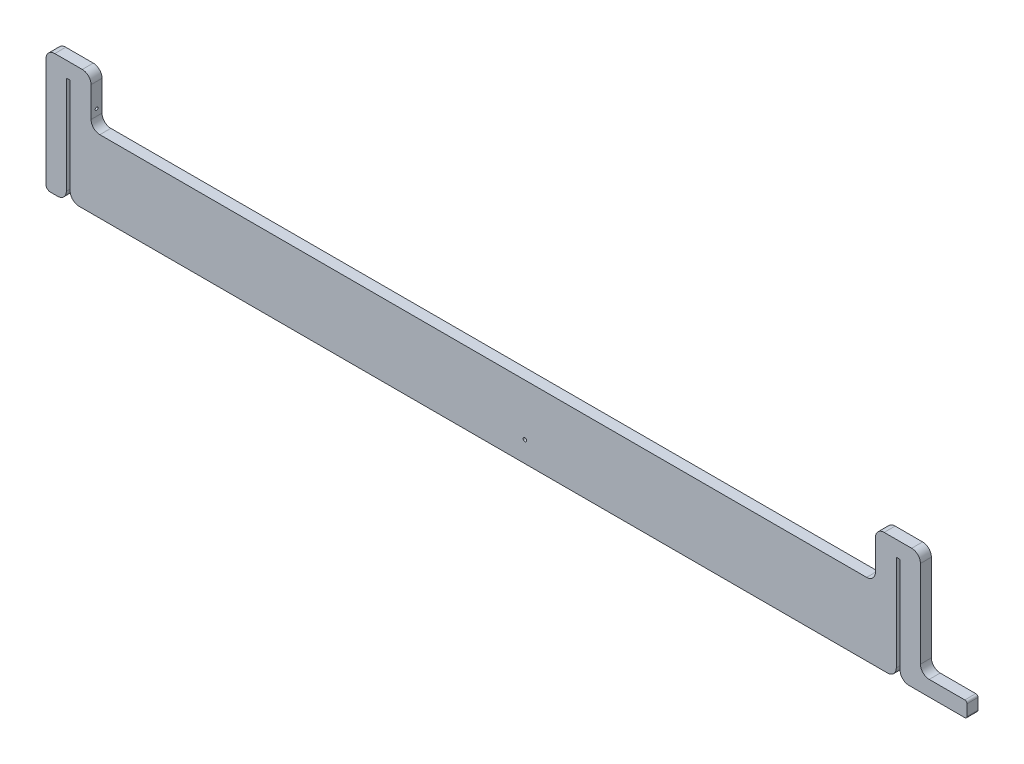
ISO-10303-21;
HEADER;
FILE_DESCRIPTION(('STEP AP214'),'2;1');
FILE_NAME('part.step','',(''),(''),'','','');
FILE_SCHEMA(('AUTOMOTIVE_DESIGN { 1 0 10303 214 1 1 1 1 }'));
ENDSEC;
DATA;
#1=APPLICATION_CONTEXT('core data for automotive mechanical design processes');
#2=APPLICATION_PROTOCOL_DEFINITION('international standard','automotive_design',2000,#1);
#3=PRODUCT_CONTEXT('',#1,'mechanical');
#4=PRODUCT('Part','Part','',(#3));
#5=PRODUCT_RELATED_PRODUCT_CATEGORY('part','',(#4));
#6=PRODUCT_DEFINITION_FORMATION('','',#4);
#7=PRODUCT_DEFINITION_CONTEXT('part definition',#1,'design');
#8=PRODUCT_DEFINITION('design','',#6,#7);
#9=PRODUCT_DEFINITION_SHAPE('','',#8);
#10=(LENGTH_UNIT() NAMED_UNIT(*) SI_UNIT(.MILLI.,.METRE.));
#11=(NAMED_UNIT(*) PLANE_ANGLE_UNIT() SI_UNIT($,.RADIAN.));
#12=(NAMED_UNIT(*) SI_UNIT($,.STERADIAN.) SOLID_ANGLE_UNIT());
#13=UNCERTAINTY_MEASURE_WITH_UNIT(LENGTH_MEASURE(1.E-05),#10,'distance_accuracy_value','');
#14=(GEOMETRIC_REPRESENTATION_CONTEXT(3) GLOBAL_UNCERTAINTY_ASSIGNED_CONTEXT((#13)) GLOBAL_UNIT_ASSIGNED_CONTEXT((#10,
#11,#12)) REPRESENTATION_CONTEXT('',''));
#15=CARTESIAN_POINT('',(0.,0.,0.));
#16=DIRECTION('',(0.,0.,1.));
#17=DIRECTION('',(1.,0.,0.));
#18=AXIS2_PLACEMENT_3D('',#15,#16,#17);
#19=CARTESIAN_POINT('',(-615.95,12.8984375,7.9375));
#20=DIRECTION('',(0.,0.,-1.));
#21=DIRECTION('',(-1.,0.,0.));
#22=AXIS2_PLACEMENT_3D('',#19,#20,#21);
#23=CYLINDRICAL_SURFACE('',#22,12.7);
#24=CARTESIAN_POINT('',(-615.95,12.8984375,-7.9375));
#25=DIRECTION('',(0.,0.,1.));
#26=DIRECTION('',(-1.,0.,0.));
#27=AXIS2_PLACEMENT_3D('',#24,#25,#26);
#28=CIRCLE('',#27,12.7);
#29=CARTESIAN_POINT('',(-615.95,0.198437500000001,-7.9375));
#30=VERTEX_POINT('',#29);
#31=CARTESIAN_POINT('',(-603.25,12.8984375,-7.9375));
#32=VERTEX_POINT('',#31);
#33=EDGE_CURVE('E298',#30,#32,#28,.T.);
#34=ORIENTED_EDGE('',*,*,#33,.T.);
#35=DIRECTION('',(0.,0.,-1.));
#36=VECTOR('',#35,1.);
#37=CARTESIAN_POINT('',(-603.25,12.8984375,7.9375));
#38=LINE('',#37,#36);
#39=CARTESIAN_POINT('',(-603.25,12.8984375,7.9375));
#40=VERTEX_POINT('',#39);
#41=EDGE_CURVE('E11',#40,#32,#38,.T.);
#42=ORIENTED_EDGE('',*,*,#41,.F.);
#43=CARTESIAN_POINT('',(-615.95,12.8984375,7.9375));
#44=DIRECTION('',(0.,0.,1.));
#45=DIRECTION('',(-1.,0.,0.));
#46=AXIS2_PLACEMENT_3D('',#43,#44,#45);
#47=CIRCLE('',#46,12.7);
#48=CARTESIAN_POINT('',(-615.95,0.198437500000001,7.9375));
#49=VERTEX_POINT('',#48);
#50=EDGE_CURVE('E369',#49,#40,#47,.T.);
#51=ORIENTED_EDGE('',*,*,#50,.F.);
#52=DIRECTION('',(0.,0.,-1.));
#53=VECTOR('',#52,1.);
#54=CARTESIAN_POINT('',(-615.95,0.198437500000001,7.9375));
#55=LINE('',#54,#53);
#56=EDGE_CURVE('E294',#49,#30,#55,.T.);
#57=ORIENTED_EDGE('',*,*,#56,.T.);
#58=EDGE_LOOP('',(#34,#42,#51,#57));
#59=FACE_BOUND('',#58,.T.);
#60=ADVANCED_FACE('F33',(#59),#23,.T.);
#61=CARTESIAN_POINT('',(-603.25,153.19375,7.9375));
#62=DIRECTION('',(-1.,0.,0.));
#63=DIRECTION('',(0.,0.,1.));
#64=AXIS2_PLACEMENT_3D('',#61,#62,#63);
#65=PLANE('',#64);
#66=DIRECTION('',(0.,1.,0.));
#67=VECTOR('',#66,1.);
#68=CARTESIAN_POINT('',(-603.25,153.19375,-7.9375));
#69=LINE('',#68,#67);
#70=CARTESIAN_POINT('',(-603.25,153.19375,-7.9375));
#71=VERTEX_POINT('',#70);
#72=EDGE_CURVE('E301',#32,#71,#69,.T.);
#73=ORIENTED_EDGE('',*,*,#72,.T.);
#74=DIRECTION('',(0.,0.,-1.));
#75=VECTOR('',#74,1.);
#76=CARTESIAN_POINT('',(-603.25,153.19375,7.9375));
#77=LINE('',#76,#75);
#78=CARTESIAN_POINT('',(-603.25,153.19375,7.9375));
#79=VERTEX_POINT('',#78);
#80=EDGE_CURVE('E42',#79,#71,#77,.T.);
#81=ORIENTED_EDGE('',*,*,#80,.F.);
#82=DIRECTION('',(0.,1.,0.));
#83=VECTOR('',#82,1.);
#84=CARTESIAN_POINT('',(-603.25,153.19375,7.9375));
#85=LINE('',#84,#83);
#86=EDGE_CURVE('E177',#40,#79,#85,.T.);
#87=ORIENTED_EDGE('',*,*,#86,.F.);
#88=ORIENTED_EDGE('',*,*,#41,.T.);
#89=EDGE_LOOP('',(#73,#81,#87,#88));
#90=FACE_BOUND('',#89,.T.);
#91=ADVANCED_FACE('F569',(#90),#65,.F.);
#92=CARTESIAN_POINT('',(-601.6625,153.19375,7.9375));
#93=DIRECTION('',(0.,0.,-1.));
#94=DIRECTION('',(-1.,0.,0.));
#95=AXIS2_PLACEMENT_3D('',#92,#93,#94);
#96=CYLINDRICAL_SURFACE('',#95,1.58749999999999);
#97=CARTESIAN_POINT('',(-601.6625,153.19375,-7.9375));
#98=DIRECTION('',(0.,0.,-1.));
#99=DIRECTION('',(1.,0.,0.));
#100=AXIS2_PLACEMENT_3D('',#97,#98,#99);
#101=CIRCLE('',#100,1.58749999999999);
#102=CARTESIAN_POINT('',(-601.6625,154.78125,-7.9375));
#103=VERTEX_POINT('',#102);
#104=EDGE_CURVE('E304',#71,#103,#101,.T.);
#105=ORIENTED_EDGE('',*,*,#104,.T.);
#106=DIRECTION('',(0.,0.,-1.));
#107=VECTOR('',#106,1.);
#108=CARTESIAN_POINT('',(-601.6625,154.78125,7.9375));
#109=LINE('',#108,#107);
#110=CARTESIAN_POINT('',(-601.6625,154.78125,7.9375));
#111=VERTEX_POINT('',#110);
#112=EDGE_CURVE('E460',#111,#103,#109,.T.);
#113=ORIENTED_EDGE('',*,*,#112,.F.);
#114=CARTESIAN_POINT('',(-601.6625,153.19375,7.9375));
#115=DIRECTION('',(0.,0.,-1.));
#116=DIRECTION('',(1.,0.,0.));
#117=AXIS2_PLACEMENT_3D('',#114,#115,#116);
#118=CIRCLE('',#117,1.58749999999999);
#119=EDGE_CURVE('E469',#79,#111,#118,.T.);
#120=ORIENTED_EDGE('',*,*,#119,.F.);
#121=ORIENTED_EDGE('',*,*,#80,.T.);
#122=EDGE_LOOP('',(#105,#113,#120,#121));
#123=FACE_BOUND('',#122,.T.);
#124=ADVANCED_FACE('F467',(#123),#96,.F.);
#125=CARTESIAN_POINT('',(-599.28125,154.78125,7.9375));
#126=DIRECTION('',(0.,1.,0.));
#127=DIRECTION('',(0.,0.,1.));
#128=AXIS2_PLACEMENT_3D('',#125,#126,#127);
#129=PLANE('',#128);
#130=DIRECTION('',(1.,0.,0.));
#131=VECTOR('',#130,1.);
#132=CARTESIAN_POINT('',(-599.28125,154.78125,-7.9375));
#133=LINE('',#132,#131);
#134=CARTESIAN_POINT('',(-599.28125,154.78125,-7.9375));
#135=VERTEX_POINT('',#134);
#136=EDGE_CURVE('E306',#103,#135,#133,.T.);
#137=ORIENTED_EDGE('',*,*,#136,.T.);
#138=DIRECTION('',(0.,0.,-1.));
#139=VECTOR('',#138,1.);
#140=CARTESIAN_POINT('',(-599.28125,154.78125,7.9375));
#141=LINE('',#140,#139);
#142=CARTESIAN_POINT('',(-599.28125,154.78125,7.9375));
#143=VERTEX_POINT('',#142);
#144=EDGE_CURVE('E457',#143,#135,#141,.T.);
#145=ORIENTED_EDGE('',*,*,#144,.F.);
#146=DIRECTION('',(1.,0.,0.));
#147=VECTOR('',#146,1.);
#148=CARTESIAN_POINT('',(-599.28125,154.78125,7.9375));
#149=LINE('',#148,#147);
#150=EDGE_CURVE('E487',#111,#143,#149,.T.);
#151=ORIENTED_EDGE('',*,*,#150,.F.);
#152=ORIENTED_EDGE('',*,*,#112,.T.);
#153=EDGE_LOOP('',(#137,#145,#151,#152));
#154=FACE_BOUND('',#153,.T.);
#155=ADVANCED_FACE('F478',(#154),#129,.F.);
#156=CARTESIAN_POINT('',(-599.28125,153.19375,7.9375));
#157=DIRECTION('',(0.,0.,-1.));
#158=DIRECTION('',(-1.,0.,0.));
#159=AXIS2_PLACEMENT_3D('',#156,#157,#158);
#160=CYLINDRICAL_SURFACE('',#159,1.58749999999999);
#161=CARTESIAN_POINT('',(-599.28125,153.19375,-7.9375));
#162=DIRECTION('',(0.,0.,-1.));
#163=DIRECTION('',(1.,0.,0.));
#164=AXIS2_PLACEMENT_3D('',#161,#162,#163);
#165=CIRCLE('',#164,1.58749999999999);
#166=CARTESIAN_POINT('',(-597.69375,153.19375,-7.9375));
#167=VERTEX_POINT('',#166);
#168=EDGE_CURVE('E308',#135,#167,#165,.T.);
#169=ORIENTED_EDGE('',*,*,#168,.T.);
#170=DIRECTION('',(0.,0.,-1.));
#171=VECTOR('',#170,1.);
#172=CARTESIAN_POINT('',(-597.69375,153.19375,7.9375));
#173=LINE('',#172,#171);
#174=CARTESIAN_POINT('',(-597.69375,153.19375,7.9375));
#175=VERTEX_POINT('',#174);
#176=EDGE_CURVE('E454',#175,#167,#173,.T.);
#177=ORIENTED_EDGE('',*,*,#176,.F.);
#178=CARTESIAN_POINT('',(-599.28125,153.19375,7.9375));
#179=DIRECTION('',(0.,0.,-1.));
#180=DIRECTION('',(1.,0.,0.));
#181=AXIS2_PLACEMENT_3D('',#178,#179,#180);
#182=CIRCLE('',#181,1.58749999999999);
#183=EDGE_CURVE('E484',#143,#175,#182,.T.);
#184=ORIENTED_EDGE('',*,*,#183,.F.);
#185=ORIENTED_EDGE('',*,*,#144,.T.);
#186=EDGE_LOOP('',(#169,#177,#184,#185));
#187=FACE_BOUND('',#186,.T.);
#188=ADVANCED_FACE('F482',(#187),#160,.F.);
#189=CARTESIAN_POINT('',(-597.69375,15.8750000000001,7.9375));
#190=DIRECTION('',(1.,0.,0.));
#191=DIRECTION('',(0.,0.,-1.));
#192=AXIS2_PLACEMENT_3D('',#189,#190,#191);
#193=PLANE('',#192);
#194=CARTESIAN_POINT('',(-597.69375,130.175,0.));
#195=DIRECTION('',(1.,0.,0.));
#196=DIRECTION('',(0.,0.,-1.));
#197=AXIS2_PLACEMENT_3D('',#194,#195,#196);
#198=CIRCLE('',#197,2.01930000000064);
#199=CARTESIAN_POINT('',(-597.69375,130.175,-2.01930000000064));
#200=VERTEX_POINT('',#199);
#201=EDGE_CURVE('E792',#200,#200,#198,.T.);
#202=ORIENTED_EDGE('',*,*,#201,.T.);
#203=EDGE_LOOP('',(#202));
#204=FACE_BOUND('',#203,.T.);
#205=DIRECTION('',(0.,-1.,0.));
#206=VECTOR('',#205,1.);
#207=CARTESIAN_POINT('',(-597.69375,15.8750000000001,-7.9375));
#208=LINE('',#207,#206);
#209=CARTESIAN_POINT('',(-597.69375,15.8750000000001,-7.9375));
#210=VERTEX_POINT('',#209);
#211=EDGE_CURVE('E310',#167,#210,#208,.T.);
#212=ORIENTED_EDGE('',*,*,#211,.T.);
#213=DIRECTION('',(0.,0.,-1.));
#214=VECTOR('',#213,1.);
#215=CARTESIAN_POINT('',(-597.69375,15.8750000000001,7.9375));
#216=LINE('',#215,#214);
#217=CARTESIAN_POINT('',(-597.69375,15.8750000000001,7.9375));
#218=VERTEX_POINT('',#217);
#219=EDGE_CURVE('E451',#218,#210,#216,.T.);
#220=ORIENTED_EDGE('',*,*,#219,.F.);
#221=DIRECTION('',(0.,-1.,0.));
#222=VECTOR('',#221,1.);
#223=CARTESIAN_POINT('',(-597.69375,15.8750000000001,7.9375));
#224=LINE('',#223,#222);
#225=EDGE_CURVE('E486',#175,#218,#224,.T.);
#226=ORIENTED_EDGE('',*,*,#225,.F.);
#227=ORIENTED_EDGE('',*,*,#176,.T.);
#228=EDGE_LOOP('',(#212,#220,#226,#227));
#229=FACE_BOUND('',#228,.T.);
#230=ADVANCED_FACE('F582',(#204,#229),#193,.F.);
#231=CARTESIAN_POINT('',(-584.99375,15.875,7.9375));
#232=DIRECTION('',(0.,0.,-1.));
#233=DIRECTION('',(-1.,0.,0.));
#234=AXIS2_PLACEMENT_3D('',#231,#232,#233);
#235=CYLINDRICAL_SURFACE('',#234,12.7);
#236=CARTESIAN_POINT('',(-584.99375,15.875,-7.9375));
#237=DIRECTION('',(0.,0.,1.));
#238=DIRECTION('',(-1.,0.,0.));
#239=AXIS2_PLACEMENT_3D('',#236,#237,#238);
#240=CIRCLE('',#239,12.7);
#241=CARTESIAN_POINT('',(-584.99375,3.17499999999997,-7.9375));
#242=VERTEX_POINT('',#241);
#243=EDGE_CURVE('E312',#210,#242,#240,.T.);
#244=ORIENTED_EDGE('',*,*,#243,.T.);
#245=DIRECTION('',(0.,0.,-1.));
#246=VECTOR('',#245,1.);
#247=CARTESIAN_POINT('',(-584.99375,3.17499999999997,7.9375));
#248=LINE('',#247,#246);
#249=CARTESIAN_POINT('',(-584.99375,3.17499999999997,7.9375));
#250=VERTEX_POINT('',#249);
#251=EDGE_CURVE('E448',#250,#242,#248,.T.);
#252=ORIENTED_EDGE('',*,*,#251,.F.);
#253=CARTESIAN_POINT('',(-584.99375,15.875,7.9375));
#254=DIRECTION('',(0.,0.,1.));
#255=DIRECTION('',(-1.,0.,0.));
#256=AXIS2_PLACEMENT_3D('',#253,#254,#255);
#257=CIRCLE('',#256,12.7);
#258=EDGE_CURVE('E489',#218,#250,#257,.T.);
#259=ORIENTED_EDGE('',*,*,#258,.F.);
#260=ORIENTED_EDGE('',*,*,#219,.T.);
#261=EDGE_LOOP('',(#244,#252,#259,#260));
#262=FACE_BOUND('',#261,.T.);
#263=ADVANCED_FACE('F585',(#262),#235,.T.);
#264=CARTESIAN_POINT('',(-584.99375,3.175,7.9375));
#265=DIRECTION('',(0.,1.,0.));
#266=DIRECTION('',(0.,0.,1.));
#267=AXIS2_PLACEMENT_3D('',#264,#265,#266);
#268=PLANE('',#267);
#269=DIRECTION('',(1.,0.,0.));
#270=VECTOR('',#269,1.);
#271=CARTESIAN_POINT('',(-584.99375,3.175,-7.9375));
#272=LINE('',#271,#270);
#273=CARTESIAN_POINT('',(584.99375,3.175,-7.9375));
#274=VERTEX_POINT('',#273);
#275=EDGE_CURVE('E314',#242,#274,#272,.T.);
#276=ORIENTED_EDGE('',*,*,#275,.T.);
#277=DIRECTION('',(0.,0.,-1.));
#278=VECTOR('',#277,1.);
#279=CARTESIAN_POINT('',(584.99375,3.175,7.9375));
#280=LINE('',#279,#278);
#281=CARTESIAN_POINT('',(584.99375,3.175,7.9375));
#282=VERTEX_POINT('',#281);
#283=EDGE_CURVE('E445',#282,#274,#280,.T.);
#284=ORIENTED_EDGE('',*,*,#283,.F.);
#285=DIRECTION('',(1.,0.,0.));
#286=VECTOR('',#285,1.);
#287=CARTESIAN_POINT('',(-584.99375,3.175,7.9375));
#288=LINE('',#287,#286);
#289=EDGE_CURVE('E495',#250,#282,#288,.T.);
#290=ORIENTED_EDGE('',*,*,#289,.F.);
#291=ORIENTED_EDGE('',*,*,#251,.T.);
#292=EDGE_LOOP('',(#276,#284,#290,#291));
#293=FACE_BOUND('',#292,.T.);
#294=ADVANCED_FACE('F589',(#293),#268,.F.);
#295=CARTESIAN_POINT('',(584.99375,15.875,7.9375));
#296=DIRECTION('',(0.,0.,-1.));
#297=DIRECTION('',(-1.,0.,0.));
#298=AXIS2_PLACEMENT_3D('',#295,#296,#297);
#299=CYLINDRICAL_SURFACE('',#298,12.7);
#300=CARTESIAN_POINT('',(584.99375,15.875,-7.9375));
#301=DIRECTION('',(0.,0.,1.));
#302=DIRECTION('',(1.,0.,0.));
#303=AXIS2_PLACEMENT_3D('',#300,#301,#302);
#304=CIRCLE('',#303,12.7);
#305=CARTESIAN_POINT('',(597.69375,15.875,-7.9375));
#306=VERTEX_POINT('',#305);
#307=EDGE_CURVE('E316',#274,#306,#304,.T.);
#308=ORIENTED_EDGE('',*,*,#307,.T.);
#309=DIRECTION('',(0.,0.,-1.));
#310=VECTOR('',#309,1.);
#311=CARTESIAN_POINT('',(597.69375,15.875,7.9375));
#312=LINE('',#311,#310);
#313=CARTESIAN_POINT('',(597.69375,15.875,7.9375));
#314=VERTEX_POINT('',#313);
#315=EDGE_CURVE('E442',#314,#306,#312,.T.);
#316=ORIENTED_EDGE('',*,*,#315,.F.);
#317=CARTESIAN_POINT('',(584.99375,15.875,7.9375));
#318=DIRECTION('',(0.,0.,1.));
#319=DIRECTION('',(1.,0.,0.));
#320=AXIS2_PLACEMENT_3D('',#317,#318,#319);
#321=CIRCLE('',#320,12.7);
#322=EDGE_CURVE('E497',#282,#314,#321,.T.);
#323=ORIENTED_EDGE('',*,*,#322,.F.);
#324=ORIENTED_EDGE('',*,*,#283,.T.);
#325=EDGE_LOOP('',(#308,#316,#323,#324));
#326=FACE_BOUND('',#325,.T.);
#327=ADVANCED_FACE('F593',(#326),#299,.T.);
#328=CARTESIAN_POINT('',(597.69375,15.875,7.9375));
#329=DIRECTION('',(-1.,0.,0.));
#330=DIRECTION('',(0.,-1.,0.));
#331=AXIS2_PLACEMENT_3D('',#328,#329,#330);
#332=PLANE('',#331);
#333=CARTESIAN_POINT('',(597.69375,130.175,0.));
#334=DIRECTION('',(-1.,0.,0.));
#335=DIRECTION('',(0.,-1.,0.));
#336=AXIS2_PLACEMENT_3D('',#333,#334,#335);
#337=CIRCLE('',#336,2.01930000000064);
#338=CARTESIAN_POINT('',(597.69375,128.155699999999,0.));
#339=VERTEX_POINT('',#338);
#340=EDGE_CURVE('E302',#339,#339,#337,.T.);
#341=ORIENTED_EDGE('',*,*,#340,.T.);
#342=EDGE_LOOP('',(#341));
#343=FACE_BOUND('',#342,.T.);
#344=DIRECTION('',(0.,1.,0.));
#345=VECTOR('',#344,1.);
#346=CARTESIAN_POINT('',(597.69375,15.875,-7.9375));
#347=LINE('',#346,#345);
#348=CARTESIAN_POINT('',(597.69375,153.19375,-7.9375));
#349=VERTEX_POINT('',#348);
#350=EDGE_CURVE('E318',#306,#349,#347,.T.);
#351=ORIENTED_EDGE('',*,*,#350,.T.);
#352=DIRECTION('',(0.,0.,-1.));
#353=VECTOR('',#352,1.);
#354=CARTESIAN_POINT('',(597.69375,153.19375,7.9375));
#355=LINE('',#354,#353);
#356=CARTESIAN_POINT('',(597.69375,153.19375,7.9375));
#357=VERTEX_POINT('',#356);
#358=EDGE_CURVE('E439',#357,#349,#355,.T.);
#359=ORIENTED_EDGE('',*,*,#358,.F.);
#360=DIRECTION('',(0.,1.,0.));
#361=VECTOR('',#360,1.);
#362=CARTESIAN_POINT('',(597.69375,15.875,7.9375));
#363=LINE('',#362,#361);
#364=EDGE_CURVE('E499',#314,#357,#363,.T.);
#365=ORIENTED_EDGE('',*,*,#364,.F.);
#366=ORIENTED_EDGE('',*,*,#315,.T.);
#367=EDGE_LOOP('',(#351,#359,#365,#366));
#368=FACE_BOUND('',#367,.T.);
#369=ADVANCED_FACE('F597',(#343,#368),#332,.F.);
#370=CARTESIAN_POINT('',(599.28125,153.19375,7.9375));
#371=DIRECTION('',(0.,0.,-1.));
#372=DIRECTION('',(-1.,0.,0.));
#373=AXIS2_PLACEMENT_3D('',#370,#371,#372);
#374=CYLINDRICAL_SURFACE('',#373,1.58750000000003);
#375=CARTESIAN_POINT('',(599.28125,153.19375,-7.9375));
#376=DIRECTION('',(0.,0.,-1.));
#377=DIRECTION('',(-1.,0.,0.));
#378=AXIS2_PLACEMENT_3D('',#375,#376,#377);
#379=CIRCLE('',#378,1.58750000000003);
#380=CARTESIAN_POINT('',(599.28125,154.78125,-7.9375));
#381=VERTEX_POINT('',#380);
#382=EDGE_CURVE('E320',#349,#381,#379,.T.);
#383=ORIENTED_EDGE('',*,*,#382,.T.);
#384=DIRECTION('',(0.,0.,-1.));
#385=VECTOR('',#384,1.);
#386=CARTESIAN_POINT('',(599.28125,154.78125,7.9375));
#387=LINE('',#386,#385);
#388=CARTESIAN_POINT('',(599.28125,154.78125,7.9375));
#389=VERTEX_POINT('',#388);
#390=EDGE_CURVE('E436',#389,#381,#387,.T.);
#391=ORIENTED_EDGE('',*,*,#390,.F.);
#392=CARTESIAN_POINT('',(599.28125,153.19375,7.9375));
#393=DIRECTION('',(0.,0.,-1.));
#394=DIRECTION('',(-1.,0.,0.));
#395=AXIS2_PLACEMENT_3D('',#392,#393,#394);
#396=CIRCLE('',#395,1.58750000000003);
#397=EDGE_CURVE('E501',#357,#389,#396,.T.);
#398=ORIENTED_EDGE('',*,*,#397,.F.);
#399=ORIENTED_EDGE('',*,*,#358,.T.);
#400=EDGE_LOOP('',(#383,#391,#398,#399));
#401=FACE_BOUND('',#400,.T.);
#402=ADVANCED_FACE('F601',(#401),#374,.F.);
#403=CARTESIAN_POINT('',(599.28125,154.78125,7.9375));
#404=DIRECTION('',(0.,1.,0.));
#405=DIRECTION('',(0.,0.,1.));
#406=AXIS2_PLACEMENT_3D('',#403,#404,#405);
#407=PLANE('',#406);
#408=DIRECTION('',(1.,0.,0.));
#409=VECTOR('',#408,1.);
#410=CARTESIAN_POINT('',(599.28125,154.78125,-7.9375));
#411=LINE('',#410,#409);
#412=CARTESIAN_POINT('',(601.6625,154.78125,-7.9375));
#413=VERTEX_POINT('',#412);
#414=EDGE_CURVE('E322',#381,#413,#411,.T.);
#415=ORIENTED_EDGE('',*,*,#414,.T.);
#416=DIRECTION('',(0.,0.,-1.));
#417=VECTOR('',#416,1.);
#418=CARTESIAN_POINT('',(601.6625,154.78125,7.9375));
#419=LINE('',#418,#417);
#420=CARTESIAN_POINT('',(601.6625,154.78125,7.9375));
#421=VERTEX_POINT('',#420);
#422=EDGE_CURVE('E433',#421,#413,#419,.T.);
#423=ORIENTED_EDGE('',*,*,#422,.F.);
#424=DIRECTION('',(1.,0.,0.));
#425=VECTOR('',#424,1.);
#426=CARTESIAN_POINT('',(599.28125,154.78125,7.9375));
#427=LINE('',#426,#425);
#428=EDGE_CURVE('E503',#389,#421,#427,.T.);
#429=ORIENTED_EDGE('',*,*,#428,.F.);
#430=ORIENTED_EDGE('',*,*,#390,.T.);
#431=EDGE_LOOP('',(#415,#423,#429,#430));
#432=FACE_BOUND('',#431,.T.);
#433=ADVANCED_FACE('F605',(#432),#407,.F.);
#434=CARTESIAN_POINT('',(601.6625,153.19375,7.9375));
#435=DIRECTION('',(0.,0.,-1.));
#436=DIRECTION('',(-1.,0.,0.));
#437=AXIS2_PLACEMENT_3D('',#434,#435,#436);
#438=CYLINDRICAL_SURFACE('',#437,1.58749999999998);
#439=CARTESIAN_POINT('',(601.6625,153.19375,-7.9375));
#440=DIRECTION('',(0.,0.,-1.));
#441=DIRECTION('',(-1.,0.,0.));
#442=AXIS2_PLACEMENT_3D('',#439,#440,#441);
#443=CIRCLE('',#442,1.58749999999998);
#444=CARTESIAN_POINT('',(603.25,153.19375,-7.9375));
#445=VERTEX_POINT('',#444);
#446=EDGE_CURVE('E324',#413,#445,#443,.T.);
#447=ORIENTED_EDGE('',*,*,#446,.T.);
#448=DIRECTION('',(0.,0.,-1.));
#449=VECTOR('',#448,1.);
#450=CARTESIAN_POINT('',(603.25,153.19375,7.9375));
#451=LINE('',#450,#449);
#452=CARTESIAN_POINT('',(603.25,153.19375,7.9375));
#453=VERTEX_POINT('',#452);
#454=EDGE_CURVE('E430',#453,#445,#451,.T.);
#455=ORIENTED_EDGE('',*,*,#454,.F.);
#456=CARTESIAN_POINT('',(601.6625,153.19375,7.9375));
#457=DIRECTION('',(0.,0.,-1.));
#458=DIRECTION('',(-1.,0.,0.));
#459=AXIS2_PLACEMENT_3D('',#456,#457,#458);
#460=CIRCLE('',#459,1.58749999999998);
#461=EDGE_CURVE('E505',#421,#453,#460,.T.);
#462=ORIENTED_EDGE('',*,*,#461,.F.);
#463=ORIENTED_EDGE('',*,*,#422,.T.);
#464=EDGE_LOOP('',(#447,#455,#462,#463));
#465=FACE_BOUND('',#464,.T.);
#466=ADVANCED_FACE('F609',(#465),#438,.F.);
#467=CARTESIAN_POINT('',(603.25,153.19375,7.9375));
#468=DIRECTION('',(1.,0.,0.));
#469=DIRECTION('',(0.,0.,-1.));
#470=AXIS2_PLACEMENT_3D('',#467,#468,#469);
#471=PLANE('',#470);
#472=DIRECTION('',(0.,-1.,0.));
#473=VECTOR('',#472,1.);
#474=CARTESIAN_POINT('',(603.25,153.19375,-7.9375));
#475=LINE('',#474,#473);
#476=CARTESIAN_POINT('',(603.25,15.875,-7.9375));
#477=VERTEX_POINT('',#476);
#478=EDGE_CURVE('E326',#445,#477,#475,.T.);
#479=ORIENTED_EDGE('',*,*,#478,.T.);
#480=DIRECTION('',(0.,0.,-1.));
#481=VECTOR('',#480,1.);
#482=CARTESIAN_POINT('',(603.25,15.875,7.9375));
#483=LINE('',#482,#481);
#484=CARTESIAN_POINT('',(603.25,15.875,7.9375));
#485=VERTEX_POINT('',#484);
#486=EDGE_CURVE('E427',#485,#477,#483,.T.);
#487=ORIENTED_EDGE('',*,*,#486,.F.);
#488=DIRECTION('',(0.,-1.,0.));
#489=VECTOR('',#488,1.);
#490=CARTESIAN_POINT('',(603.25,153.19375,7.9375));
#491=LINE('',#490,#489);
#492=EDGE_CURVE('E507',#453,#485,#491,.T.);
#493=ORIENTED_EDGE('',*,*,#492,.F.);
#494=ORIENTED_EDGE('',*,*,#454,.T.);
#495=EDGE_LOOP('',(#479,#487,#493,#494));
#496=FACE_BOUND('',#495,.T.);
#497=ADVANCED_FACE('F613',(#496),#471,.F.);
#498=CARTESIAN_POINT('',(615.95,15.875,7.9375));
#499=DIRECTION('',(0.,0.,-1.));
#500=DIRECTION('',(-1.,0.,0.));
#501=AXIS2_PLACEMENT_3D('',#498,#499,#500);
#502=CYLINDRICAL_SURFACE('',#501,12.7);
#503=CARTESIAN_POINT('',(615.95,15.875,-7.9375));
#504=DIRECTION('',(0.,0.,1.));
#505=DIRECTION('',(-1.,0.,0.));
#506=AXIS2_PLACEMENT_3D('',#503,#504,#505);
#507=CIRCLE('',#506,12.7);
#508=CARTESIAN_POINT('',(615.95,3.17499999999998,-7.9375));
#509=VERTEX_POINT('',#508);
#510=EDGE_CURVE('E328',#477,#509,#507,.T.);
#511=ORIENTED_EDGE('',*,*,#510,.T.);
#512=DIRECTION('',(0.,0.,-1.));
#513=VECTOR('',#512,1.);
#514=CARTESIAN_POINT('',(615.95,3.17499999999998,7.9375));
#515=LINE('',#514,#513);
#516=CARTESIAN_POINT('',(615.95,3.17499999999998,7.9375));
#517=VERTEX_POINT('',#516);
#518=EDGE_CURVE('E424',#517,#509,#515,.T.);
#519=ORIENTED_EDGE('',*,*,#518,.F.);
#520=CARTESIAN_POINT('',(615.95,15.875,7.9375));
#521=DIRECTION('',(0.,0.,1.));
#522=DIRECTION('',(-1.,0.,0.));
#523=AXIS2_PLACEMENT_3D('',#520,#521,#522);
#524=CIRCLE('',#523,12.7);
#525=EDGE_CURVE('E509',#485,#517,#524,.T.);
#526=ORIENTED_EDGE('',*,*,#525,.F.);
#527=ORIENTED_EDGE('',*,*,#486,.T.);
#528=EDGE_LOOP('',(#511,#519,#526,#527));
#529=FACE_BOUND('',#528,.T.);
#530=ADVANCED_FACE('F617',(#529),#502,.T.);
#531=CARTESIAN_POINT('',(615.95,3.175,7.9375));
#532=DIRECTION('',(0.,1.,0.));
#533=DIRECTION('',(-1.,0.,0.));
#534=AXIS2_PLACEMENT_3D('',#531,#532,#533);
#535=PLANE('',#534);
#536=DIRECTION('',(1.,0.,0.));
#537=VECTOR('',#536,1.);
#538=CARTESIAN_POINT('',(615.95,3.175,-7.9375));
#539=LINE('',#538,#537);
#540=CARTESIAN_POINT('',(696.9125,3.175,-7.9375));
#541=VERTEX_POINT('',#540);
#542=EDGE_CURVE('E330',#509,#541,#539,.T.);
#543=ORIENTED_EDGE('',*,*,#542,.T.);
#544=DIRECTION('',(0.,0.,-1.));
#545=VECTOR('',#544,1.);
#546=CARTESIAN_POINT('',(696.9125,3.175,7.9375));
#547=LINE('',#546,#545);
#548=CARTESIAN_POINT('',(696.9125,3.175,7.9375));
#549=VERTEX_POINT('',#548);
#550=EDGE_CURVE('E421',#549,#541,#547,.T.);
#551=ORIENTED_EDGE('',*,*,#550,.F.);
#552=DIRECTION('',(1.,0.,0.));
#553=VECTOR('',#552,1.);
#554=CARTESIAN_POINT('',(615.95,3.175,7.9375));
#555=LINE('',#554,#553);
#556=EDGE_CURVE('E511',#517,#549,#555,.T.);
#557=ORIENTED_EDGE('',*,*,#556,.F.);
#558=ORIENTED_EDGE('',*,*,#518,.T.);
#559=EDGE_LOOP('',(#543,#551,#557,#558));
#560=FACE_BOUND('',#559,.T.);
#561=ADVANCED_FACE('F621',(#560),#535,.F.);
#562=CARTESIAN_POINT('',(696.9125,6.35,7.9375));
#563=DIRECTION('',(0.,0.,-1.));
#564=DIRECTION('',(-1.,0.,0.));
#565=AXIS2_PLACEMENT_3D('',#562,#563,#564);
#566=CYLINDRICAL_SURFACE('',#565,3.17500000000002);
#567=CARTESIAN_POINT('',(696.9125,6.35,-7.9375));
#568=DIRECTION('',(0.,0.,1.));
#569=DIRECTION('',(1.,0.,0.));
#570=AXIS2_PLACEMENT_3D('',#567,#568,#569);
#571=CIRCLE('',#570,3.17500000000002);
#572=CARTESIAN_POINT('',(700.0875,6.35,-7.9375));
#573=VERTEX_POINT('',#572);
#574=EDGE_CURVE('E332',#541,#573,#571,.T.);
#575=ORIENTED_EDGE('',*,*,#574,.T.);
#576=DIRECTION('',(0.,0.,-1.));
#577=VECTOR('',#576,1.);
#578=CARTESIAN_POINT('',(700.0875,6.35,7.9375));
#579=LINE('',#578,#577);
#580=CARTESIAN_POINT('',(700.0875,6.35,7.9375));
#581=VERTEX_POINT('',#580);
#582=EDGE_CURVE('E418',#581,#573,#579,.T.);
#583=ORIENTED_EDGE('',*,*,#582,.F.);
#584=CARTESIAN_POINT('',(696.9125,6.35,7.9375));
#585=DIRECTION('',(0.,0.,1.));
#586=DIRECTION('',(1.,0.,0.));
#587=AXIS2_PLACEMENT_3D('',#584,#585,#586);
#588=CIRCLE('',#587,3.17500000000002);
#589=EDGE_CURVE('E513',#549,#581,#588,.T.);
#590=ORIENTED_EDGE('',*,*,#589,.F.);
#591=ORIENTED_EDGE('',*,*,#550,.T.);
#592=EDGE_LOOP('',(#575,#583,#590,#591));
#593=FACE_BOUND('',#592,.T.);
#594=ADVANCED_FACE('F625',(#593),#566,.T.);
#595=CARTESIAN_POINT('',(700.0875,22.225,7.9375));
#596=DIRECTION('',(-1.,0.,0.));
#597=DIRECTION('',(0.,0.,1.));
#598=AXIS2_PLACEMENT_3D('',#595,#596,#597);
#599=PLANE('',#598);
#600=DIRECTION('',(0.,1.,0.));
#601=VECTOR('',#600,1.);
#602=CARTESIAN_POINT('',(700.0875,22.225,-7.9375));
#603=LINE('',#602,#601);
#604=CARTESIAN_POINT('',(700.0875,22.225,-7.9375));
#605=VERTEX_POINT('',#604);
#606=EDGE_CURVE('E334',#573,#605,#603,.T.);
#607=ORIENTED_EDGE('',*,*,#606,.T.);
#608=DIRECTION('',(0.,0.,-1.));
#609=VECTOR('',#608,1.);
#610=CARTESIAN_POINT('',(700.0875,22.225,7.9375));
#611=LINE('',#610,#609);
#612=CARTESIAN_POINT('',(700.0875,22.225,7.9375));
#613=VERTEX_POINT('',#612);
#614=EDGE_CURVE('E415',#613,#605,#611,.T.);
#615=ORIENTED_EDGE('',*,*,#614,.F.);
#616=DIRECTION('',(0.,1.,0.));
#617=VECTOR('',#616,1.);
#618=CARTESIAN_POINT('',(700.0875,22.225,7.9375));
#619=LINE('',#618,#617);
#620=EDGE_CURVE('E515',#581,#613,#619,.T.);
#621=ORIENTED_EDGE('',*,*,#620,.F.);
#622=ORIENTED_EDGE('',*,*,#582,.T.);
#623=EDGE_LOOP('',(#607,#615,#621,#622));
#624=FACE_BOUND('',#623,.T.);
#625=ADVANCED_FACE('F629',(#624),#599,.F.);
#626=CARTESIAN_POINT('',(696.9125,22.225,7.9375));
#627=DIRECTION('',(0.,0.,-1.));
#628=DIRECTION('',(-1.,0.,0.));
#629=AXIS2_PLACEMENT_3D('',#626,#627,#628);
#630=CYLINDRICAL_SURFACE('',#629,3.17500000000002);
#631=CARTESIAN_POINT('',(696.9125,22.225,-7.9375));
#632=DIRECTION('',(0.,0.,1.));
#633=DIRECTION('',(-1.,0.,0.));
#634=AXIS2_PLACEMENT_3D('',#631,#632,#633);
#635=CIRCLE('',#634,3.17500000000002);
#636=CARTESIAN_POINT('',(696.9125,25.4,-7.9375));
#637=VERTEX_POINT('',#636);
#638=EDGE_CURVE('E336',#605,#637,#635,.T.);
#639=ORIENTED_EDGE('',*,*,#638,.T.);
#640=DIRECTION('',(0.,0.,-1.));
#641=VECTOR('',#640,1.);
#642=CARTESIAN_POINT('',(696.9125,25.4,7.9375));
#643=LINE('',#642,#641);
#644=CARTESIAN_POINT('',(696.9125,25.4,7.9375));
#645=VERTEX_POINT('',#644);
#646=EDGE_CURVE('E412',#645,#637,#643,.T.);
#647=ORIENTED_EDGE('',*,*,#646,.F.);
#648=CARTESIAN_POINT('',(696.9125,22.225,7.9375));
#649=DIRECTION('',(0.,0.,1.));
#650=DIRECTION('',(-1.,0.,0.));
#651=AXIS2_PLACEMENT_3D('',#648,#649,#650);
#652=CIRCLE('',#651,3.17500000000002);
#653=EDGE_CURVE('E517',#613,#645,#652,.T.);
#654=ORIENTED_EDGE('',*,*,#653,.F.);
#655=ORIENTED_EDGE('',*,*,#614,.T.);
#656=EDGE_LOOP('',(#639,#647,#654,#655));
#657=FACE_BOUND('',#656,.T.);
#658=ADVANCED_FACE('F633',(#657),#630,.T.);
#659=CARTESIAN_POINT('',(645.3632,25.4,7.9375));
#660=DIRECTION('',(0.,-1.,0.));
#661=DIRECTION('',(1.,0.,0.));
#662=AXIS2_PLACEMENT_3D('',#659,#660,#661);
#663=PLANE('',#662);
#664=DIRECTION('',(-1.,0.,0.));
#665=VECTOR('',#664,1.);
#666=CARTESIAN_POINT('',(645.3632,25.4,-7.9375));
#667=LINE('',#666,#665);
#668=CARTESIAN_POINT('',(645.3632,25.4,-7.9375));
#669=VERTEX_POINT('',#668);
#670=EDGE_CURVE('E338',#637,#669,#667,.T.);
#671=ORIENTED_EDGE('',*,*,#670,.T.);
#672=DIRECTION('',(0.,0.,-1.));
#673=VECTOR('',#672,1.);
#674=CARTESIAN_POINT('',(645.3632,25.4,7.9375));
#675=LINE('',#674,#673);
#676=CARTESIAN_POINT('',(645.3632,25.4,7.9375));
#677=VERTEX_POINT('',#676);
#678=EDGE_CURVE('E409',#677,#669,#675,.T.);
#679=ORIENTED_EDGE('',*,*,#678,.F.);
#680=DIRECTION('',(-1.,0.,0.));
#681=VECTOR('',#680,1.);
#682=CARTESIAN_POINT('',(645.3632,25.4,7.9375));
#683=LINE('',#682,#681);
#684=EDGE_CURVE('E519',#645,#677,#683,.T.);
#685=ORIENTED_EDGE('',*,*,#684,.F.);
#686=ORIENTED_EDGE('',*,*,#646,.T.);
#687=EDGE_LOOP('',(#671,#679,#685,#686));
#688=FACE_BOUND('',#687,.T.);
#689=ADVANCED_FACE('F637',(#688),#663,.F.);
#690=CARTESIAN_POINT('',(645.3632,38.1,7.9375));
#691=DIRECTION('',(0.,0.,-1.));
#692=DIRECTION('',(-1.,0.,0.));
#693=AXIS2_PLACEMENT_3D('',#690,#691,#692);
#694=CYLINDRICAL_SURFACE('',#693,12.7);
#695=CARTESIAN_POINT('',(645.3632,38.1,-7.9375));
#696=DIRECTION('',(0.,0.,-1.));
#697=DIRECTION('',(1.,0.,0.));
#698=AXIS2_PLACEMENT_3D('',#695,#696,#697);
#699=CIRCLE('',#698,12.7);
#700=CARTESIAN_POINT('',(632.6632,38.1,-7.9375));
#701=VERTEX_POINT('',#700);
#702=EDGE_CURVE('E340',#669,#701,#699,.T.);
#703=ORIENTED_EDGE('',*,*,#702,.T.);
#704=DIRECTION('',(0.,0.,-1.));
#705=VECTOR('',#704,1.);
#706=CARTESIAN_POINT('',(632.6632,38.1,7.9375));
#707=LINE('',#706,#705);
#708=CARTESIAN_POINT('',(632.6632,38.1,7.9375));
#709=VERTEX_POINT('',#708);
#710=EDGE_CURVE('E406',#709,#701,#707,.T.);
#711=ORIENTED_EDGE('',*,*,#710,.F.);
#712=CARTESIAN_POINT('',(645.3632,38.1,7.9375));
#713=DIRECTION('',(0.,0.,-1.));
#714=DIRECTION('',(1.,0.,0.));
#715=AXIS2_PLACEMENT_3D('',#712,#713,#714);
#716=CIRCLE('',#715,12.7);
#717=EDGE_CURVE('E521',#677,#709,#716,.T.);
#718=ORIENTED_EDGE('',*,*,#717,.F.);
#719=ORIENTED_EDGE('',*,*,#678,.T.);
#720=EDGE_LOOP('',(#703,#711,#718,#719));
#721=FACE_BOUND('',#720,.T.);
#722=ADVANCED_FACE('F641',(#721),#694,.F.);
#723=CARTESIAN_POINT('',(632.6632,164.30625,7.9375));
#724=DIRECTION('',(-1.,0.,0.));
#725=DIRECTION('',(0.,0.,1.));
#726=AXIS2_PLACEMENT_3D('',#723,#724,#725);
#727=PLANE('',#726);
#728=DIRECTION('',(0.,1.,0.));
#729=VECTOR('',#728,1.);
#730=CARTESIAN_POINT('',(632.6632,164.30625,-7.9375));
#731=LINE('',#730,#729);
#732=CARTESIAN_POINT('',(632.6632,164.30625,-7.9375));
#733=VERTEX_POINT('',#732);
#734=EDGE_CURVE('E342',#701,#733,#731,.T.);
#735=ORIENTED_EDGE('',*,*,#734,.T.);
#736=DIRECTION('',(0.,0.,-1.));
#737=VECTOR('',#736,1.);
#738=CARTESIAN_POINT('',(632.6632,164.30625,7.9375));
#739=LINE('',#738,#737);
#740=CARTESIAN_POINT('',(632.6632,164.30625,7.9375));
#741=VERTEX_POINT('',#740);
#742=EDGE_CURVE('E403',#741,#733,#739,.T.);
#743=ORIENTED_EDGE('',*,*,#742,.F.);
#744=DIRECTION('',(0.,1.,0.));
#745=VECTOR('',#744,1.);
#746=CARTESIAN_POINT('',(632.6632,164.30625,7.9375));
#747=LINE('',#746,#745);
#748=EDGE_CURVE('E523',#709,#741,#747,.T.);
#749=ORIENTED_EDGE('',*,*,#748,.F.);
#750=ORIENTED_EDGE('',*,*,#710,.T.);
#751=EDGE_LOOP('',(#735,#743,#749,#750));
#752=FACE_BOUND('',#751,.T.);
#753=ADVANCED_FACE('F645',(#752),#727,.F.);
#754=CARTESIAN_POINT('',(619.9632,164.30625,7.9375));
#755=DIRECTION('',(0.,0.,-1.));
#756=DIRECTION('',(-1.,0.,0.));
#757=AXIS2_PLACEMENT_3D('',#754,#755,#756);
#758=CYLINDRICAL_SURFACE('',#757,12.7);
#759=CARTESIAN_POINT('',(619.9632,164.30625,-7.9375));
#760=DIRECTION('',(0.,0.,1.));
#761=DIRECTION('',(-1.,0.,0.));
#762=AXIS2_PLACEMENT_3D('',#759,#760,#761);
#763=CIRCLE('',#762,12.7);
#764=CARTESIAN_POINT('',(619.9632,177.00625,-7.9375));
#765=VERTEX_POINT('',#764);
#766=EDGE_CURVE('E344',#733,#765,#763,.T.);
#767=ORIENTED_EDGE('',*,*,#766,.T.);
#768=DIRECTION('',(0.,0.,-1.));
#769=VECTOR('',#768,1.);
#770=CARTESIAN_POINT('',(619.9632,177.00625,7.9375));
#771=LINE('',#770,#769);
#772=CARTESIAN_POINT('',(619.9632,177.00625,7.9375));
#773=VERTEX_POINT('',#772);
#774=EDGE_CURVE('E400',#773,#765,#771,.T.);
#775=ORIENTED_EDGE('',*,*,#774,.F.);
#776=CARTESIAN_POINT('',(619.9632,164.30625,7.9375));
#777=DIRECTION('',(0.,0.,1.));
#778=DIRECTION('',(-1.,0.,0.));
#779=AXIS2_PLACEMENT_3D('',#776,#777,#778);
#780=CIRCLE('',#779,12.7);
#781=EDGE_CURVE('E525',#741,#773,#780,.T.);
#782=ORIENTED_EDGE('',*,*,#781,.F.);
#783=ORIENTED_EDGE('',*,*,#742,.T.);
#784=EDGE_LOOP('',(#767,#775,#782,#783));
#785=FACE_BOUND('',#784,.T.);
#786=ADVANCED_FACE('F649',(#785),#758,.T.);
#787=CARTESIAN_POINT('',(580.16775,177.00625,7.9375));
#788=DIRECTION('',(0.,-1.,0.));
#789=DIRECTION('',(1.,0.,0.));
#790=AXIS2_PLACEMENT_3D('',#787,#788,#789);
#791=PLANE('',#790);
#792=DIRECTION('',(-1.,0.,0.));
#793=VECTOR('',#792,1.);
#794=CARTESIAN_POINT('',(580.16775,177.00625,-7.9375));
#795=LINE('',#794,#793);
#796=CARTESIAN_POINT('',(580.16775,177.00625,-7.9375));
#797=VERTEX_POINT('',#796);
#798=EDGE_CURVE('E346',#765,#797,#795,.T.);
#799=ORIENTED_EDGE('',*,*,#798,.T.);
#800=DIRECTION('',(0.,0.,-1.));
#801=VECTOR('',#800,1.);
#802=CARTESIAN_POINT('',(580.16775,177.00625,7.9375));
#803=LINE('',#802,#801);
#804=CARTESIAN_POINT('',(580.16775,177.00625,7.9375));
#805=VERTEX_POINT('',#804);
#806=EDGE_CURVE('E397',#805,#797,#803,.T.);
#807=ORIENTED_EDGE('',*,*,#806,.F.);
#808=DIRECTION('',(-1.,0.,0.));
#809=VECTOR('',#808,1.);
#810=CARTESIAN_POINT('',(580.16775,177.00625,7.9375));
#811=LINE('',#810,#809);
#812=EDGE_CURVE('E527',#773,#805,#811,.T.);
#813=ORIENTED_EDGE('',*,*,#812,.F.);
#814=ORIENTED_EDGE('',*,*,#774,.T.);
#815=EDGE_LOOP('',(#799,#807,#813,#814));
#816=FACE_BOUND('',#815,.T.);
#817=ADVANCED_FACE('F653',(#816),#791,.F.);
#818=CARTESIAN_POINT('',(580.16775,164.30625,7.9375));
#819=DIRECTION('',(0.,0.,-1.));
#820=DIRECTION('',(-1.,0.,0.));
#821=AXIS2_PLACEMENT_3D('',#818,#819,#820);
#822=CYLINDRICAL_SURFACE('',#821,12.7);
#823=CARTESIAN_POINT('',(580.16775,164.30625,-7.9375));
#824=DIRECTION('',(0.,0.,1.));
#825=DIRECTION('',(-1.,0.,0.));
#826=AXIS2_PLACEMENT_3D('',#823,#824,#825);
#827=CIRCLE('',#826,12.7);
#828=CARTESIAN_POINT('',(567.46775,164.30625,-7.9375));
#829=VERTEX_POINT('',#828);
#830=EDGE_CURVE('E348',#797,#829,#827,.T.);
#831=ORIENTED_EDGE('',*,*,#830,.T.);
#832=DIRECTION('',(0.,0.,-1.));
#833=VECTOR('',#832,1.);
#834=CARTESIAN_POINT('',(567.46775,164.30625,7.9375));
#835=LINE('',#834,#833);
#836=CARTESIAN_POINT('',(567.46775,164.30625,7.9375));
#837=VERTEX_POINT('',#836);
#838=EDGE_CURVE('E394',#837,#829,#835,.T.);
#839=ORIENTED_EDGE('',*,*,#838,.F.);
#840=CARTESIAN_POINT('',(580.16775,164.30625,7.9375));
#841=DIRECTION('',(0.,0.,1.));
#842=DIRECTION('',(-1.,0.,0.));
#843=AXIS2_PLACEMENT_3D('',#840,#841,#842);
#844=CIRCLE('',#843,12.7);
#845=EDGE_CURVE('E529',#805,#837,#844,.T.);
#846=ORIENTED_EDGE('',*,*,#845,.F.);
#847=ORIENTED_EDGE('',*,*,#806,.T.);
#848=EDGE_LOOP('',(#831,#839,#846,#847));
#849=FACE_BOUND('',#848,.T.);
#850=ADVANCED_FACE('F657',(#849),#822,.T.);
#851=CARTESIAN_POINT('',(567.46775,120.65,7.9375));
#852=DIRECTION('',(1.,0.,0.));
#853=DIRECTION('',(0.,1.,0.));
#854=AXIS2_PLACEMENT_3D('',#851,#852,#853);
#855=PLANE('',#854);
#856=CARTESIAN_POINT('',(567.46775,130.175,0.));
#857=DIRECTION('',(-1.,0.,0.));
#858=DIRECTION('',(0.,-1.,0.));
#859=AXIS2_PLACEMENT_3D('',#856,#857,#858);
#860=CIRCLE('',#859,2.01930000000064);
#861=CARTESIAN_POINT('',(567.46775,128.155699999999,0.));
#862=VERTEX_POINT('',#861);
#863=EDGE_CURVE('E797',#862,#862,#860,.T.);
#864=ORIENTED_EDGE('',*,*,#863,.F.);
#865=EDGE_LOOP('',(#864));
#866=FACE_BOUND('',#865,.T.);
#867=DIRECTION('',(0.,-1.,0.));
#868=VECTOR('',#867,1.);
#869=CARTESIAN_POINT('',(567.46775,120.65,-7.9375));
#870=LINE('',#869,#868);
#871=CARTESIAN_POINT('',(567.46775,120.65,-7.9375));
#872=VERTEX_POINT('',#871);
#873=EDGE_CURVE('E350',#829,#872,#870,.T.);
#874=ORIENTED_EDGE('',*,*,#873,.T.);
#875=DIRECTION('',(0.,0.,-1.));
#876=VECTOR('',#875,1.);
#877=CARTESIAN_POINT('',(567.46775,120.65,7.9375));
#878=LINE('',#877,#876);
#879=CARTESIAN_POINT('',(567.46775,120.65,7.9375));
#880=VERTEX_POINT('',#879);
#881=EDGE_CURVE('E391',#880,#872,#878,.T.);
#882=ORIENTED_EDGE('',*,*,#881,.F.);
#883=DIRECTION('',(0.,-1.,0.));
#884=VECTOR('',#883,1.);
#885=CARTESIAN_POINT('',(567.46775,120.65,7.9375));
#886=LINE('',#885,#884);
#887=EDGE_CURVE('E531',#837,#880,#886,.T.);
#888=ORIENTED_EDGE('',*,*,#887,.F.);
#889=ORIENTED_EDGE('',*,*,#838,.T.);
#890=EDGE_LOOP('',(#874,#882,#888,#889));
#891=FACE_BOUND('',#890,.T.);
#892=ADVANCED_FACE('F661',(#866,#891),#855,.F.);
#893=CARTESIAN_POINT('',(554.76775,120.65,7.9375));
#894=DIRECTION('',(0.,0.,-1.));
#895=DIRECTION('',(-1.,0.,0.));
#896=AXIS2_PLACEMENT_3D('',#893,#894,#895);
#897=CYLINDRICAL_SURFACE('',#896,12.7000000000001);
#898=CARTESIAN_POINT('',(554.76775,120.65,-7.9375));
#899=DIRECTION('',(0.,0.,-1.));
#900=DIRECTION('',(1.,0.,0.));
#901=AXIS2_PLACEMENT_3D('',#898,#899,#900);
#902=CIRCLE('',#901,12.7000000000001);
#903=CARTESIAN_POINT('',(554.76775,107.95,-7.9375));
#904=VERTEX_POINT('',#903);
#905=EDGE_CURVE('E352',#872,#904,#902,.T.);
#906=ORIENTED_EDGE('',*,*,#905,.T.);
#907=DIRECTION('',(0.,0.,-1.));
#908=VECTOR('',#907,1.);
#909=CARTESIAN_POINT('',(554.76775,107.95,7.9375));
#910=LINE('',#909,#908);
#911=CARTESIAN_POINT('',(554.76775,107.95,7.9375));
#912=VERTEX_POINT('',#911);
#913=EDGE_CURVE('E388',#912,#904,#910,.T.);
#914=ORIENTED_EDGE('',*,*,#913,.F.);
#915=CARTESIAN_POINT('',(554.76775,120.65,7.9375));
#916=DIRECTION('',(0.,0.,-1.));
#917=DIRECTION('',(1.,0.,0.));
#918=AXIS2_PLACEMENT_3D('',#915,#916,#917);
#919=CIRCLE('',#918,12.7000000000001);
#920=EDGE_CURVE('E533',#880,#912,#919,.T.);
#921=ORIENTED_EDGE('',*,*,#920,.F.);
#922=ORIENTED_EDGE('',*,*,#881,.T.);
#923=EDGE_LOOP('',(#906,#914,#921,#922));
#924=FACE_BOUND('',#923,.T.);
#925=ADVANCED_FACE('F665',(#924),#897,.F.);
#926=CARTESIAN_POINT('',(-554.76775,107.95,7.9375));
#927=DIRECTION('',(0.,-1.,0.));
#928=DIRECTION('',(0.,0.,-1.));
#929=AXIS2_PLACEMENT_3D('',#926,#927,#928);
#930=PLANE('',#929);
#931=DIRECTION('',(-1.,0.,0.));
#932=VECTOR('',#931,1.);
#933=CARTESIAN_POINT('',(-554.76775,107.95,-7.9375));
#934=LINE('',#933,#932);
#935=CARTESIAN_POINT('',(-554.76775,107.95,-7.9375));
#936=VERTEX_POINT('',#935);
#937=EDGE_CURVE('E354',#904,#936,#934,.T.);
#938=ORIENTED_EDGE('',*,*,#937,.T.);
#939=DIRECTION('',(0.,0.,-1.));
#940=VECTOR('',#939,1.);
#941=CARTESIAN_POINT('',(-554.76775,107.95,7.9375));
#942=LINE('',#941,#940);
#943=CARTESIAN_POINT('',(-554.76775,107.95,7.9375));
#944=VERTEX_POINT('',#943);
#945=EDGE_CURVE('E385',#944,#936,#942,.T.);
#946=ORIENTED_EDGE('',*,*,#945,.F.);
#947=DIRECTION('',(-1.,0.,0.));
#948=VECTOR('',#947,1.);
#949=CARTESIAN_POINT('',(-554.76775,107.95,7.9375));
#950=LINE('',#949,#948);
#951=EDGE_CURVE('E535',#912,#944,#950,.T.);
#952=ORIENTED_EDGE('',*,*,#951,.F.);
#953=ORIENTED_EDGE('',*,*,#913,.T.);
#954=EDGE_LOOP('',(#938,#946,#952,#953));
#955=FACE_BOUND('',#954,.T.);
#956=ADVANCED_FACE('F669',(#955),#930,.F.);
#957=CARTESIAN_POINT('',(-554.76775,120.65,7.9375));
#958=DIRECTION('',(0.,0.,-1.));
#959=DIRECTION('',(-1.,0.,0.));
#960=AXIS2_PLACEMENT_3D('',#957,#958,#959);
#961=CYLINDRICAL_SURFACE('',#960,12.7);
#962=CARTESIAN_POINT('',(-554.76775,120.65,-7.9375));
#963=DIRECTION('',(0.,0.,-1.));
#964=DIRECTION('',(-1.,0.,0.));
#965=AXIS2_PLACEMENT_3D('',#962,#963,#964);
#966=CIRCLE('',#965,12.7);
#967=CARTESIAN_POINT('',(-567.46775,120.65,-7.9375));
#968=VERTEX_POINT('',#967);
#969=EDGE_CURVE('E356',#936,#968,#966,.T.);
#970=ORIENTED_EDGE('',*,*,#969,.T.);
#971=DIRECTION('',(0.,0.,-1.));
#972=VECTOR('',#971,1.);
#973=CARTESIAN_POINT('',(-567.46775,120.65,7.9375));
#974=LINE('',#973,#972);
#975=CARTESIAN_POINT('',(-567.46775,120.65,7.9375));
#976=VERTEX_POINT('',#975);
#977=EDGE_CURVE('E382',#976,#968,#974,.T.);
#978=ORIENTED_EDGE('',*,*,#977,.F.);
#979=CARTESIAN_POINT('',(-554.76775,120.65,7.9375));
#980=DIRECTION('',(0.,0.,-1.));
#981=DIRECTION('',(-1.,0.,0.));
#982=AXIS2_PLACEMENT_3D('',#979,#980,#981);
#983=CIRCLE('',#982,12.7);
#984=EDGE_CURVE('E537',#944,#976,#983,.T.);
#985=ORIENTED_EDGE('',*,*,#984,.F.);
#986=ORIENTED_EDGE('',*,*,#945,.T.);
#987=EDGE_LOOP('',(#970,#978,#985,#986));
#988=FACE_BOUND('',#987,.T.);
#989=ADVANCED_FACE('F673',(#988),#961,.F.);
#990=CARTESIAN_POINT('',(-567.46775,164.30625,7.9375));
#991=DIRECTION('',(-1.,0.,0.));
#992=DIRECTION('',(0.,0.,1.));
#993=AXIS2_PLACEMENT_3D('',#990,#991,#992);
#994=PLANE('',#993);
#995=CARTESIAN_POINT('',(-567.46775,130.175,0.));
#996=DIRECTION('',(1.,0.,0.));
#997=DIRECTION('',(0.,0.,-1.));
#998=AXIS2_PLACEMENT_3D('',#995,#996,#997);
#999=CIRCLE('',#998,2.01930000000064);
#1000=CARTESIAN_POINT('',(-567.46775,130.175,-2.01930000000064));
#1001=VERTEX_POINT('',#1000);
#1002=EDGE_CURVE('E789',#1001,#1001,#999,.T.);
#1003=ORIENTED_EDGE('',*,*,#1002,.F.);
#1004=EDGE_LOOP('',(#1003));
#1005=FACE_BOUND('',#1004,.T.);
#1006=DIRECTION('',(0.,1.,0.));
#1007=VECTOR('',#1006,1.);
#1008=CARTESIAN_POINT('',(-567.46775,164.30625,-7.9375));
#1009=LINE('',#1008,#1007);
#1010=CARTESIAN_POINT('',(-567.46775,164.30625,-7.9375));
#1011=VERTEX_POINT('',#1010);
#1012=EDGE_CURVE('E358',#968,#1011,#1009,.T.);
#1013=ORIENTED_EDGE('',*,*,#1012,.T.);
#1014=DIRECTION('',(0.,0.,-1.));
#1015=VECTOR('',#1014,1.);
#1016=CARTESIAN_POINT('',(-567.46775,164.30625,7.9375));
#1017=LINE('',#1016,#1015);
#1018=CARTESIAN_POINT('',(-567.46775,164.30625,7.9375));
#1019=VERTEX_POINT('',#1018);
#1020=EDGE_CURVE('E379',#1019,#1011,#1017,.T.);
#1021=ORIENTED_EDGE('',*,*,#1020,.F.);
#1022=DIRECTION('',(0.,1.,0.));
#1023=VECTOR('',#1022,1.);
#1024=CARTESIAN_POINT('',(-567.46775,164.30625,7.9375));
#1025=LINE('',#1024,#1023);
#1026=EDGE_CURVE('E539',#976,#1019,#1025,.T.);
#1027=ORIENTED_EDGE('',*,*,#1026,.F.);
#1028=ORIENTED_EDGE('',*,*,#977,.T.);
#1029=EDGE_LOOP('',(#1013,#1021,#1027,#1028));
#1030=FACE_BOUND('',#1029,.T.);
#1031=ADVANCED_FACE('F677',(#1005,#1030),#994,.F.);
#1032=CARTESIAN_POINT('',(-580.16775,164.30625,7.9375));
#1033=DIRECTION('',(0.,0.,-1.));
#1034=DIRECTION('',(-1.,0.,0.));
#1035=AXIS2_PLACEMENT_3D('',#1032,#1033,#1034);
#1036=CYLINDRICAL_SURFACE('',#1035,12.7);
#1037=CARTESIAN_POINT('',(-580.16775,164.30625,-7.9375));
#1038=DIRECTION('',(0.,0.,1.));
#1039=DIRECTION('',(1.,0.,0.));
#1040=AXIS2_PLACEMENT_3D('',#1037,#1038,#1039);
#1041=CIRCLE('',#1040,12.7);
#1042=CARTESIAN_POINT('',(-580.16775,177.00625,-7.9375));
#1043=VERTEX_POINT('',#1042);
#1044=EDGE_CURVE('E360',#1011,#1043,#1041,.T.);
#1045=ORIENTED_EDGE('',*,*,#1044,.T.);
#1046=DIRECTION('',(0.,0.,-1.));
#1047=VECTOR('',#1046,1.);
#1048=CARTESIAN_POINT('',(-580.16775,177.00625,7.9375));
#1049=LINE('',#1048,#1047);
#1050=CARTESIAN_POINT('',(-580.16775,177.00625,7.9375));
#1051=VERTEX_POINT('',#1050);
#1052=EDGE_CURVE('E376',#1051,#1043,#1049,.T.);
#1053=ORIENTED_EDGE('',*,*,#1052,.F.);
#1054=CARTESIAN_POINT('',(-580.16775,164.30625,7.9375));
#1055=DIRECTION('',(0.,0.,1.));
#1056=DIRECTION('',(1.,0.,0.));
#1057=AXIS2_PLACEMENT_3D('',#1054,#1055,#1056);
#1058=CIRCLE('',#1057,12.7);
#1059=EDGE_CURVE('E541',#1019,#1051,#1058,.T.);
#1060=ORIENTED_EDGE('',*,*,#1059,.F.);
#1061=ORIENTED_EDGE('',*,*,#1020,.T.);
#1062=EDGE_LOOP('',(#1045,#1053,#1060,#1061));
#1063=FACE_BOUND('',#1062,.T.);
#1064=ADVANCED_FACE('F681',(#1063),#1036,.T.);
#1065=CARTESIAN_POINT('',(-580.16775,177.00625,7.9375));
#1066=DIRECTION('',(0.,-1.,0.));
#1067=DIRECTION('',(0.,0.,-1.));
#1068=AXIS2_PLACEMENT_3D('',#1065,#1066,#1067);
#1069=PLANE('',#1068);
#1070=DIRECTION('',(-1.,0.,0.));
#1071=VECTOR('',#1070,1.);
#1072=CARTESIAN_POINT('',(-580.16775,177.00625,-7.9375));
#1073=LINE('',#1072,#1071);
#1074=CARTESIAN_POINT('',(-619.9632,177.00625,-7.9375));
#1075=VERTEX_POINT('',#1074);
#1076=EDGE_CURVE('E362',#1043,#1075,#1073,.T.);
#1077=ORIENTED_EDGE('',*,*,#1076,.T.);
#1078=DIRECTION('',(0.,0.,-1.));
#1079=VECTOR('',#1078,1.);
#1080=CARTESIAN_POINT('',(-619.9632,177.00625,7.9375));
#1081=LINE('',#1080,#1079);
#1082=CARTESIAN_POINT('',(-619.9632,177.00625,7.9375));
#1083=VERTEX_POINT('',#1082);
#1084=EDGE_CURVE('E373',#1083,#1075,#1081,.T.);
#1085=ORIENTED_EDGE('',*,*,#1084,.F.);
#1086=DIRECTION('',(-1.,0.,0.));
#1087=VECTOR('',#1086,1.);
#1088=CARTESIAN_POINT('',(-580.16775,177.00625,7.9375));
#1089=LINE('',#1088,#1087);
#1090=EDGE_CURVE('E543',#1051,#1083,#1089,.T.);
#1091=ORIENTED_EDGE('',*,*,#1090,.F.);
#1092=ORIENTED_EDGE('',*,*,#1052,.T.);
#1093=EDGE_LOOP('',(#1077,#1085,#1091,#1092));
#1094=FACE_BOUND('',#1093,.T.);
#1095=ADVANCED_FACE('F549',(#1094),#1069,.F.);
#1096=CARTESIAN_POINT('',(-619.9632,164.30625,7.9375));
#1097=DIRECTION('',(0.,0.,-1.));
#1098=DIRECTION('',(-1.,0.,0.));
#1099=AXIS2_PLACEMENT_3D('',#1096,#1097,#1098);
#1100=CYLINDRICAL_SURFACE('',#1099,12.7);
#1101=CARTESIAN_POINT('',(-619.9632,164.30625,-7.9375));
#1102=DIRECTION('',(0.,0.,1.));
#1103=DIRECTION('',(1.,0.,0.));
#1104=AXIS2_PLACEMENT_3D('',#1101,#1102,#1103);
#1105=CIRCLE('',#1104,12.7);
#1106=CARTESIAN_POINT('',(-632.6632,164.30625,-7.9375));
#1107=VERTEX_POINT('',#1106);
#1108=EDGE_CURVE('E364',#1075,#1107,#1105,.T.);
#1109=ORIENTED_EDGE('',*,*,#1108,.T.);
#1110=DIRECTION('',(0.,0.,-1.));
#1111=VECTOR('',#1110,1.);
#1112=CARTESIAN_POINT('',(-632.6632,164.30625,7.9375));
#1113=LINE('',#1112,#1111);
#1114=CARTESIAN_POINT('',(-632.6632,164.30625,7.9375));
#1115=VERTEX_POINT('',#1114);
#1116=EDGE_CURVE('E289',#1115,#1107,#1113,.T.);
#1117=ORIENTED_EDGE('',*,*,#1116,.F.);
#1118=CARTESIAN_POINT('',(-619.9632,164.30625,7.9375));
#1119=DIRECTION('',(0.,0.,1.));
#1120=DIRECTION('',(1.,0.,0.));
#1121=AXIS2_PLACEMENT_3D('',#1118,#1119,#1120);
#1122=CIRCLE('',#1121,12.7);
#1123=EDGE_CURVE('E280',#1083,#1115,#1122,.T.);
#1124=ORIENTED_EDGE('',*,*,#1123,.F.);
#1125=ORIENTED_EDGE('',*,*,#1084,.T.);
#1126=EDGE_LOOP('',(#1109,#1117,#1124,#1125));
#1127=FACE_BOUND('',#1126,.T.);
#1128=ADVANCED_FACE('F553',(#1127),#1100,.T.);
#1129=CARTESIAN_POINT('',(-632.6632,164.30625,7.9375));
#1130=DIRECTION('',(1.,0.,0.));
#1131=DIRECTION('',(0.,1.,0.));
#1132=AXIS2_PLACEMENT_3D('',#1129,#1130,#1131);
#1133=PLANE('',#1132);
#1134=DIRECTION('',(0.,-1.,0.));
#1135=VECTOR('',#1134,1.);
#1136=CARTESIAN_POINT('',(-632.6632,164.30625,-7.9375));
#1137=LINE('',#1136,#1135);
#1138=CARTESIAN_POINT('',(-632.6632,6.5484375,-7.9375));
#1139=VERTEX_POINT('',#1138);
#1140=EDGE_CURVE('E288',#1107,#1139,#1137,.T.);
#1141=ORIENTED_EDGE('',*,*,#1140,.T.);
#1142=DIRECTION('',(0.,0.,-1.));
#1143=VECTOR('',#1142,1.);
#1144=CARTESIAN_POINT('',(-632.6632,6.5484375,7.9375));
#1145=LINE('',#1144,#1143);
#1146=CARTESIAN_POINT('',(-632.6632,6.5484375,7.9375));
#1147=VERTEX_POINT('',#1146);
#1148=EDGE_CURVE('E285',#1147,#1139,#1145,.T.);
#1149=ORIENTED_EDGE('',*,*,#1148,.F.);
#1150=DIRECTION('',(0.,-1.,0.));
#1151=VECTOR('',#1150,1.);
#1152=CARTESIAN_POINT('',(-632.6632,164.30625,7.9375));
#1153=LINE('',#1152,#1151);
#1154=EDGE_CURVE('E274',#1115,#1147,#1153,.T.);
#1155=ORIENTED_EDGE('',*,*,#1154,.F.);
#1156=ORIENTED_EDGE('',*,*,#1116,.T.);
#1157=EDGE_LOOP('',(#1141,#1149,#1155,#1156));
#1158=FACE_BOUND('',#1157,.T.);
#1159=ADVANCED_FACE('F286',(#1158),#1133,.F.);
#1160=CARTESIAN_POINT('',(-626.3132,6.5484375,7.9375));
#1161=DIRECTION('',(0.,0.,-1.));
#1162=DIRECTION('',(-1.,0.,0.));
#1163=AXIS2_PLACEMENT_3D('',#1160,#1161,#1162);
#1164=CYLINDRICAL_SURFACE('',#1163,6.34999999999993);
#1165=CARTESIAN_POINT('',(-626.3132,6.5484375,-7.9375));
#1166=DIRECTION('',(0.,0.,1.));
#1167=DIRECTION('',(1.,0.,0.));
#1168=AXIS2_PLACEMENT_3D('',#1165,#1166,#1167);
#1169=CIRCLE('',#1168,6.34999999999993);
#1170=CARTESIAN_POINT('',(-626.3132,0.198437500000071,-7.9375));
#1171=VERTEX_POINT('',#1170);
#1172=EDGE_CURVE('E163',#1139,#1171,#1169,.T.);
#1173=ORIENTED_EDGE('',*,*,#1172,.T.);
#1174=DIRECTION('',(0.,0.,-1.));
#1175=VECTOR('',#1174,1.);
#1176=CARTESIAN_POINT('',(-626.3132,0.198437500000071,7.9375));
#1177=LINE('',#1176,#1175);
#1178=CARTESIAN_POINT('',(-626.3132,0.198437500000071,7.9375));
#1179=VERTEX_POINT('',#1178);
#1180=EDGE_CURVE('E290',#1179,#1171,#1177,.T.);
#1181=ORIENTED_EDGE('',*,*,#1180,.F.);
#1182=CARTESIAN_POINT('',(-626.3132,6.5484375,7.9375));
#1183=DIRECTION('',(0.,0.,1.));
#1184=DIRECTION('',(1.,0.,0.));
#1185=AXIS2_PLACEMENT_3D('',#1182,#1183,#1184);
#1186=CIRCLE('',#1185,6.34999999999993);
#1187=EDGE_CURVE('E278',#1147,#1179,#1186,.T.);
#1188=ORIENTED_EDGE('',*,*,#1187,.F.);
#1189=ORIENTED_EDGE('',*,*,#1148,.T.);
#1190=EDGE_LOOP('',(#1173,#1181,#1188,#1189));
#1191=FACE_BOUND('',#1190,.T.);
#1192=ADVANCED_FACE('F292',(#1191),#1164,.T.);
#1193=CARTESIAN_POINT('',(-615.95,0.198437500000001,7.9375));
#1194=DIRECTION('',(0.,1.,0.));
#1195=DIRECTION('',(-1.,0.,0.));
#1196=AXIS2_PLACEMENT_3D('',#1193,#1194,#1195);
#1197=PLANE('',#1196);
#1198=DIRECTION('',(1.,0.,0.));
#1199=VECTOR('',#1198,1.);
#1200=CARTESIAN_POINT('',(-615.95,0.198437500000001,-7.9375));
#1201=LINE('',#1200,#1199);
#1202=EDGE_CURVE('E169',#1171,#30,#1201,.T.);
#1203=ORIENTED_EDGE('',*,*,#1202,.T.);
#1204=ORIENTED_EDGE('',*,*,#56,.F.);
#1205=DIRECTION('',(1.,0.,0.));
#1206=VECTOR('',#1205,1.);
#1207=CARTESIAN_POINT('',(-615.95,0.198437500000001,7.9375));
#1208=LINE('',#1207,#1206);
#1209=EDGE_CURVE('E50',#1179,#49,#1208,.T.);
#1210=ORIENTED_EDGE('',*,*,#1209,.F.);
#1211=ORIENTED_EDGE('',*,*,#1180,.T.);
#1212=EDGE_LOOP('',(#1203,#1204,#1210,#1211));
#1213=FACE_BOUND('',#1212,.T.);
#1214=ADVANCED_FACE('F557',(#1213),#1197,.F.);
#1215=CARTESIAN_POINT('',(-615.95,12.8984375,7.9375));
#1216=DIRECTION('',(0.,0.,-1.));
#1217=DIRECTION('',(-1.,0.,0.));
#1218=AXIS2_PLACEMENT_3D('',#1215,#1216,#1217);
#1219=PLANE('',#1218);
#1220=CARTESIAN_POINT('',(60.325,33.3375,7.9375));
#1221=DIRECTION('',(0.,0.,-1.));
#1222=DIRECTION('',(-1.,0.,0.));
#1223=AXIS2_PLACEMENT_3D('',#1220,#1221,#1222);
#1224=CIRCLE('',#1223,2.53999999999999);
#1225=CARTESIAN_POINT('',(57.785,33.3375,7.9375));
#1226=VERTEX_POINT('',#1225);
#1227=EDGE_CURVE('E788',#1226,#1226,#1224,.T.);
#1228=ORIENTED_EDGE('',*,*,#1227,.T.);
#1229=EDGE_LOOP('',(#1228));
#1230=FACE_BOUND('',#1229,.T.);
#1231=ORIENTED_EDGE('',*,*,#50,.T.);
#1232=ORIENTED_EDGE('',*,*,#86,.T.);
#1233=ORIENTED_EDGE('',*,*,#119,.T.);
#1234=ORIENTED_EDGE('',*,*,#150,.T.);
#1235=ORIENTED_EDGE('',*,*,#183,.T.);
#1236=ORIENTED_EDGE('',*,*,#225,.T.);
#1237=ORIENTED_EDGE('',*,*,#258,.T.);
#1238=ORIENTED_EDGE('',*,*,#289,.T.);
#1239=ORIENTED_EDGE('',*,*,#322,.T.);
#1240=ORIENTED_EDGE('',*,*,#364,.T.);
#1241=ORIENTED_EDGE('',*,*,#397,.T.);
#1242=ORIENTED_EDGE('',*,*,#428,.T.);
#1243=ORIENTED_EDGE('',*,*,#461,.T.);
#1244=ORIENTED_EDGE('',*,*,#492,.T.);
#1245=ORIENTED_EDGE('',*,*,#525,.T.);
#1246=ORIENTED_EDGE('',*,*,#556,.T.);
#1247=ORIENTED_EDGE('',*,*,#589,.T.);
#1248=ORIENTED_EDGE('',*,*,#620,.T.);
#1249=ORIENTED_EDGE('',*,*,#653,.T.);
#1250=ORIENTED_EDGE('',*,*,#684,.T.);
#1251=ORIENTED_EDGE('',*,*,#717,.T.);
#1252=ORIENTED_EDGE('',*,*,#748,.T.);
#1253=ORIENTED_EDGE('',*,*,#781,.T.);
#1254=ORIENTED_EDGE('',*,*,#812,.T.);
#1255=ORIENTED_EDGE('',*,*,#845,.T.);
#1256=ORIENTED_EDGE('',*,*,#887,.T.);
#1257=ORIENTED_EDGE('',*,*,#920,.T.);
#1258=ORIENTED_EDGE('',*,*,#951,.T.);
#1259=ORIENTED_EDGE('',*,*,#984,.T.);
#1260=ORIENTED_EDGE('',*,*,#1026,.T.);
#1261=ORIENTED_EDGE('',*,*,#1059,.T.);
#1262=ORIENTED_EDGE('',*,*,#1090,.T.);
#1263=ORIENTED_EDGE('',*,*,#1123,.T.);
#1264=ORIENTED_EDGE('',*,*,#1154,.T.);
#1265=ORIENTED_EDGE('',*,*,#1187,.T.);
#1266=ORIENTED_EDGE('',*,*,#1209,.T.);
#1267=EDGE_LOOP('',(#1231,#1232,#1233,#1234,#1235,#1236,#1237,#1238,#1239,#1240,#1241,#1242,
#1243,#1244,#1245,#1246,#1247,#1248,#1249,#1250,#1251,#1252,#1253,#1254,#1255,#1256,#1257,#1258,
#1259,#1260,#1261,#1262,#1263,#1264,#1265,#1266));
#1268=FACE_BOUND('',#1267,.T.);
#1269=ADVANCED_FACE('F276',(#1230,#1268),#1219,.F.);
#1270=CARTESIAN_POINT('',(-615.95,12.8984375,-7.9375));
#1271=DIRECTION('',(0.,0.,-1.));
#1272=DIRECTION('',(-1.,0.,0.));
#1273=AXIS2_PLACEMENT_3D('',#1270,#1271,#1272);
#1274=PLANE('',#1273);
#1275=CARTESIAN_POINT('',(60.325,33.3375,-7.9375));
#1276=DIRECTION('',(0.,0.,-1.));
#1277=DIRECTION('',(-1.,0.,0.));
#1278=AXIS2_PLACEMENT_3D('',#1275,#1276,#1277);
#1279=CIRCLE('',#1278,2.53999999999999);
#1280=CARTESIAN_POINT('',(57.785,33.3375,-7.9375));
#1281=VERTEX_POINT('',#1280);
#1282=EDGE_CURVE('E36',#1281,#1281,#1279,.T.);
#1283=ORIENTED_EDGE('',*,*,#1282,.F.);
#1284=EDGE_LOOP('',(#1283));
#1285=FACE_BOUND('',#1284,.T.);
#1286=ORIENTED_EDGE('',*,*,#33,.F.);
#1287=ORIENTED_EDGE('',*,*,#1202,.F.);
#1288=ORIENTED_EDGE('',*,*,#1172,.F.);
#1289=ORIENTED_EDGE('',*,*,#1140,.F.);
#1290=ORIENTED_EDGE('',*,*,#1108,.F.);
#1291=ORIENTED_EDGE('',*,*,#1076,.F.);
#1292=ORIENTED_EDGE('',*,*,#1044,.F.);
#1293=ORIENTED_EDGE('',*,*,#1012,.F.);
#1294=ORIENTED_EDGE('',*,*,#969,.F.);
#1295=ORIENTED_EDGE('',*,*,#937,.F.);
#1296=ORIENTED_EDGE('',*,*,#905,.F.);
#1297=ORIENTED_EDGE('',*,*,#873,.F.);
#1298=ORIENTED_EDGE('',*,*,#830,.F.);
#1299=ORIENTED_EDGE('',*,*,#798,.F.);
#1300=ORIENTED_EDGE('',*,*,#766,.F.);
#1301=ORIENTED_EDGE('',*,*,#734,.F.);
#1302=ORIENTED_EDGE('',*,*,#702,.F.);
#1303=ORIENTED_EDGE('',*,*,#670,.F.);
#1304=ORIENTED_EDGE('',*,*,#638,.F.);
#1305=ORIENTED_EDGE('',*,*,#606,.F.);
#1306=ORIENTED_EDGE('',*,*,#574,.F.);
#1307=ORIENTED_EDGE('',*,*,#542,.F.);
#1308=ORIENTED_EDGE('',*,*,#510,.F.);
#1309=ORIENTED_EDGE('',*,*,#478,.F.);
#1310=ORIENTED_EDGE('',*,*,#446,.F.);
#1311=ORIENTED_EDGE('',*,*,#414,.F.);
#1312=ORIENTED_EDGE('',*,*,#382,.F.);
#1313=ORIENTED_EDGE('',*,*,#350,.F.);
#1314=ORIENTED_EDGE('',*,*,#307,.F.);
#1315=ORIENTED_EDGE('',*,*,#275,.F.);
#1316=ORIENTED_EDGE('',*,*,#243,.F.);
#1317=ORIENTED_EDGE('',*,*,#211,.F.);
#1318=ORIENTED_EDGE('',*,*,#168,.F.);
#1319=ORIENTED_EDGE('',*,*,#136,.F.);
#1320=ORIENTED_EDGE('',*,*,#104,.F.);
#1321=ORIENTED_EDGE('',*,*,#72,.F.);
#1322=EDGE_LOOP('',(#1286,#1287,#1288,#1289,#1290,#1291,#1292,#1293,#1294,#1295,#1296,#1297,
#1298,#1299,#1300,#1301,#1302,#1303,#1304,#1305,#1306,#1307,#1308,#1309,#1310,#1311,#1312,#1313,
#1314,#1315,#1316,#1317,#1318,#1319,#1320,#1321));
#1323=FACE_BOUND('',#1322,.T.);
#1324=ADVANCED_FACE('F473',(#1285,#1323),#1274,.T.);
#1325=CARTESIAN_POINT('',(597.94775,130.175,0.));
#1326=DIRECTION('',(-1.,0.,0.));
#1327=DIRECTION('',(0.,-1.,0.));
#1328=AXIS2_PLACEMENT_3D('',#1325,#1326,#1327);
#1329=CYLINDRICAL_SURFACE('',#1328,2.01930000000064);
#1330=CARTESIAN_POINT('',(567.46775,128.155699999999,0.));
#1331=CARTESIAN_POINT('',(567.782604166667,128.155699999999,0.));
#1332=CARTESIAN_POINT('',(568.097458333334,128.155699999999,0.));
#1333=CARTESIAN_POINT('',(568.727166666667,128.155699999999,0.));
#1334=CARTESIAN_POINT('',(569.042020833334,128.155699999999,0.));
#1335=CARTESIAN_POINT('',(569.671729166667,128.155699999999,0.));
#1336=CARTESIAN_POINT('',(569.986583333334,128.155699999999,0.));
#1337=CARTESIAN_POINT('',(570.616291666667,128.155699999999,0.));
#1338=CARTESIAN_POINT('',(570.931145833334,128.155699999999,0.));
#1339=CARTESIAN_POINT('',(571.560854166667,128.155699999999,0.));
#1340=CARTESIAN_POINT('',(571.875708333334,128.155699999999,0.));
#1341=CARTESIAN_POINT('',(572.505416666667,128.155699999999,0.));
#1342=CARTESIAN_POINT('',(572.820270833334,128.155699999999,0.));
#1343=CARTESIAN_POINT('',(573.449979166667,128.155699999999,0.));
#1344=CARTESIAN_POINT('',(573.764833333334,128.155699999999,0.));
#1345=CARTESIAN_POINT('',(574.394541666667,128.155699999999,0.));
#1346=CARTESIAN_POINT('',(574.709395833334,128.155699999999,0.));
#1347=CARTESIAN_POINT('',(575.339104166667,128.155699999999,0.));
#1348=CARTESIAN_POINT('',(575.653958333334,128.155699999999,0.));
#1349=CARTESIAN_POINT('',(576.283666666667,128.155699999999,0.));
#1350=CARTESIAN_POINT('',(576.598520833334,128.155699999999,0.));
#1351=CARTESIAN_POINT('',(577.228229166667,128.155699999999,0.));
#1352=CARTESIAN_POINT('',(577.543083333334,128.155699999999,0.));
#1353=CARTESIAN_POINT('',(578.172791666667,128.155699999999,0.));
#1354=CARTESIAN_POINT('',(578.487645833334,128.155699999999,0.));
#1355=CARTESIAN_POINT('',(579.117354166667,128.155699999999,0.));
#1356=CARTESIAN_POINT('',(579.432208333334,128.155699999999,0.));
#1357=CARTESIAN_POINT('',(580.061916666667,128.155699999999,0.));
#1358=CARTESIAN_POINT('',(580.376770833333,128.155699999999,0.));
#1359=CARTESIAN_POINT('',(581.006479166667,128.155699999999,0.));
#1360=CARTESIAN_POINT('',(581.321333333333,128.155699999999,0.));
#1361=CARTESIAN_POINT('',(581.951041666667,128.155699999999,0.));
#1362=CARTESIAN_POINT('',(582.265895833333,128.155699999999,0.));
#1363=CARTESIAN_POINT('',(582.895604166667,128.155699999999,0.));
#1364=CARTESIAN_POINT('',(583.210458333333,128.155699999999,0.));
#1365=CARTESIAN_POINT('',(583.840166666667,128.155699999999,0.));
#1366=CARTESIAN_POINT('',(584.155020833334,128.155699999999,0.));
#1367=CARTESIAN_POINT('',(584.784729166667,128.155699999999,0.));
#1368=CARTESIAN_POINT('',(585.099583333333,128.155699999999,0.));
#1369=CARTESIAN_POINT('',(585.729291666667,128.155699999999,0.));
#1370=CARTESIAN_POINT('',(586.044145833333,128.155699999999,0.));
#1371=CARTESIAN_POINT('',(586.673854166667,128.155699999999,0.));
#1372=CARTESIAN_POINT('',(586.988708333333,128.155699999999,0.));
#1373=CARTESIAN_POINT('',(587.618416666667,128.155699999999,0.));
#1374=CARTESIAN_POINT('',(587.933270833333,128.155699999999,0.));
#1375=CARTESIAN_POINT('',(588.562979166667,128.155699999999,0.));
#1376=CARTESIAN_POINT('',(588.877833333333,128.155699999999,0.));
#1377=CARTESIAN_POINT('',(589.507541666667,128.155699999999,0.));
#1378=CARTESIAN_POINT('',(589.822395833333,128.155699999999,0.));
#1379=CARTESIAN_POINT('',(590.452104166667,128.155699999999,0.));
#1380=CARTESIAN_POINT('',(590.766958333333,128.155699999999,0.));
#1381=CARTESIAN_POINT('',(591.396666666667,128.155699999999,0.));
#1382=CARTESIAN_POINT('',(591.711520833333,128.155699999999,0.));
#1383=CARTESIAN_POINT('',(592.341229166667,128.155699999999,0.));
#1384=CARTESIAN_POINT('',(592.656083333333,128.155699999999,0.));
#1385=CARTESIAN_POINT('',(593.285791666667,128.155699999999,0.));
#1386=CARTESIAN_POINT('',(593.600645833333,128.155699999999,0.));
#1387=CARTESIAN_POINT('',(594.230354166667,128.155699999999,0.));
#1388=CARTESIAN_POINT('',(594.545208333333,128.155699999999,0.));
#1389=CARTESIAN_POINT('',(595.174916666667,128.155699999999,0.));
#1390=CARTESIAN_POINT('',(595.489770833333,128.155699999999,0.));
#1391=CARTESIAN_POINT('',(596.119479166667,128.155699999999,0.));
#1392=CARTESIAN_POINT('',(596.434333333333,128.155699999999,0.));
#1393=CARTESIAN_POINT('',(597.064041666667,128.155699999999,0.));
#1394=CARTESIAN_POINT('',(597.378895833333,128.155699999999,0.));
#1395=CARTESIAN_POINT('',(597.69375,128.155699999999,0.));
#1396=B_SPLINE_CURVE_WITH_KNOTS('',3,(#1330,#1331,#1332,#1333,#1334,#1335,#1336,#1337,#1338,
#1339,#1340,#1341,#1342,#1343,#1344,#1345,#1346,#1347,#1348,#1349,#1350,#1351,#1352,#1353,#1354,
#1355,#1356,#1357,#1358,#1359,#1360,#1361,#1362,#1363,#1364,#1365,#1366,#1367,#1368,#1369,#1370,
#1371,#1372,#1373,#1374,#1375,#1376,#1377,#1378,#1379,#1380,#1381,#1382,#1383,#1384,#1385,#1386,
#1387,#1388,#1389,#1390,#1391,#1392,#1393,#1394,#1395),.UNSPECIFIED.,.F.,.F.,(4,2,2,2,2,2,2,2,2,
2,2,2,2,2,2,2,2,2,2,2,2,2,2,2,2,2,2,2,2,2,2,2,4),(0.,0.944562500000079,1.88912500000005,
2.83368750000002,3.77824999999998,4.72281249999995,5.66737499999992,6.61193749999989,
7.55649999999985,8.50106249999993,9.4456249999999,10.3901874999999,11.3347499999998,
12.2793124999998,13.2238749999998,14.1684374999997,15.1129999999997,16.0575624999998,
17.0021249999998,17.9466874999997,18.8912499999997,19.8358124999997,20.7803749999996,
21.7249374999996,22.6694999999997,23.6140624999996,24.5586249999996,25.5031874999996,
26.4477499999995,27.3923124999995,28.3368749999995,29.2814374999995,30.2259999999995),.UNSPECIFIED.);
#1397=EDGE_CURVE('BSEAM725',#862,#339,#1396,.T.);
#1398=ORIENTED_EDGE('',*,*,#863,.T.);
#1399=ORIENTED_EDGE('',*,*,#340,.F.);
#1400=ORIENTED_EDGE('',*,*,#1397,.T.);
#1401=ORIENTED_EDGE('',*,*,#1397,.F.);
#1402=EDGE_LOOP('',(#1398,#1400,#1399,#1401));
#1403=FACE_BOUND('',#1402,.T.);
#1404=ADVANCED_FACE('F725',(#1403),#1329,.F.);
#1405=CARTESIAN_POINT('',(-597.94775,130.175,0.));
#1406=DIRECTION('',(1.,0.,0.));
#1407=DIRECTION('',(0.,0.,-1.));
#1408=AXIS2_PLACEMENT_3D('',#1405,#1406,#1407);
#1409=CYLINDRICAL_SURFACE('',#1408,2.01930000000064);
#1410=CARTESIAN_POINT('',(-567.46775,130.175,-2.01930000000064));
#1411=CARTESIAN_POINT('',(-567.782604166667,130.175,-2.01930000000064));
#1412=CARTESIAN_POINT('',(-568.097458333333,130.175,-2.01930000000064));
#1413=CARTESIAN_POINT('',(-568.727166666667,130.175,-2.01930000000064));
#1414=CARTESIAN_POINT('',(-569.042020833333,130.175,-2.01930000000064));
#1415=CARTESIAN_POINT('',(-569.671729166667,130.175,-2.01930000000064));
#1416=CARTESIAN_POINT('',(-569.986583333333,130.175,-2.01930000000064));
#1417=CARTESIAN_POINT('',(-570.616291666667,130.175,-2.01930000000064));
#1418=CARTESIAN_POINT('',(-570.931145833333,130.175,-2.01930000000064));
#1419=CARTESIAN_POINT('',(-571.560854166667,130.175,-2.01930000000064));
#1420=CARTESIAN_POINT('',(-571.875708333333,130.175,-2.01930000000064));
#1421=CARTESIAN_POINT('',(-572.505416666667,130.175,-2.01930000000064));
#1422=CARTESIAN_POINT('',(-572.820270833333,130.175,-2.01930000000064));
#1423=CARTESIAN_POINT('',(-573.449979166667,130.175,-2.01930000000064));
#1424=CARTESIAN_POINT('',(-573.764833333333,130.175,-2.01930000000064));
#1425=CARTESIAN_POINT('',(-574.394541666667,130.175,-2.01930000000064));
#1426=CARTESIAN_POINT('',(-574.709395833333,130.175,-2.01930000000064));
#1427=CARTESIAN_POINT('',(-575.339104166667,130.175,-2.01930000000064));
#1428=CARTESIAN_POINT('',(-575.653958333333,130.175,-2.01930000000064));
#1429=CARTESIAN_POINT('',(-576.283666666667,130.175,-2.01930000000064));
#1430=CARTESIAN_POINT('',(-576.598520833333,130.175,-2.01930000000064));
#1431=CARTESIAN_POINT('',(-577.228229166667,130.175,-2.01930000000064));
#1432=CARTESIAN_POINT('',(-577.543083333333,130.175,-2.01930000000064));
#1433=CARTESIAN_POINT('',(-578.172791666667,130.175,-2.01930000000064));
#1434=CARTESIAN_POINT('',(-578.487645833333,130.175,-2.01930000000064));
#1435=CARTESIAN_POINT('',(-579.117354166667,130.175,-2.01930000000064));
#1436=CARTESIAN_POINT('',(-579.432208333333,130.175,-2.01930000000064));
#1437=CARTESIAN_POINT('',(-580.061916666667,130.175,-2.01930000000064));
#1438=CARTESIAN_POINT('',(-580.376770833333,130.175,-2.01930000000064));
#1439=CARTESIAN_POINT('',(-581.006479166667,130.175,-2.01930000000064));
#1440=CARTESIAN_POINT('',(-581.321333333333,130.175,-2.01930000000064));
#1441=CARTESIAN_POINT('',(-581.951041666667,130.175,-2.01930000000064));
#1442=CARTESIAN_POINT('',(-582.265895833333,130.175,-2.01930000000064));
#1443=CARTESIAN_POINT('',(-582.895604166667,130.175,-2.01930000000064));
#1444=CARTESIAN_POINT('',(-583.210458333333,130.175,-2.01930000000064));
#1445=CARTESIAN_POINT('',(-583.840166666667,130.175,-2.01930000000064));
#1446=CARTESIAN_POINT('',(-584.155020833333,130.175,-2.01930000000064));
#1447=CARTESIAN_POINT('',(-584.784729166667,130.175,-2.01930000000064));
#1448=CARTESIAN_POINT('',(-585.099583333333,130.175,-2.01930000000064));
#1449=CARTESIAN_POINT('',(-585.729291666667,130.175,-2.01930000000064));
#1450=CARTESIAN_POINT('',(-586.044145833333,130.175,-2.01930000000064));
#1451=CARTESIAN_POINT('',(-586.673854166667,130.175,-2.01930000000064));
#1452=CARTESIAN_POINT('',(-586.988708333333,130.175,-2.01930000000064));
#1453=CARTESIAN_POINT('',(-587.618416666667,130.175,-2.01930000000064));
#1454=CARTESIAN_POINT('',(-587.933270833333,130.175,-2.01930000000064));
#1455=CARTESIAN_POINT('',(-588.562979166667,130.175,-2.01930000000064));
#1456=CARTESIAN_POINT('',(-588.877833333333,130.175,-2.01930000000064));
#1457=CARTESIAN_POINT('',(-589.507541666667,130.175,-2.01930000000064));
#1458=CARTESIAN_POINT('',(-589.822395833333,130.175,-2.01930000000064));
#1459=CARTESIAN_POINT('',(-590.452104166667,130.175,-2.01930000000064));
#1460=CARTESIAN_POINT('',(-590.766958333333,130.175,-2.01930000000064));
#1461=CARTESIAN_POINT('',(-591.396666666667,130.175,-2.01930000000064));
#1462=CARTESIAN_POINT('',(-591.711520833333,130.175,-2.01930000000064));
#1463=CARTESIAN_POINT('',(-592.341229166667,130.175,-2.01930000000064));
#1464=CARTESIAN_POINT('',(-592.656083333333,130.175,-2.01930000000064));
#1465=CARTESIAN_POINT('',(-593.285791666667,130.175,-2.01930000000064));
#1466=CARTESIAN_POINT('',(-593.600645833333,130.175,-2.01930000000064));
#1467=CARTESIAN_POINT('',(-594.230354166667,130.175,-2.01930000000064));
#1468=CARTESIAN_POINT('',(-594.545208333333,130.175,-2.01930000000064));
#1469=CARTESIAN_POINT('',(-595.174916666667,130.175,-2.01930000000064));
#1470=CARTESIAN_POINT('',(-595.489770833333,130.175,-2.01930000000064));
#1471=CARTESIAN_POINT('',(-596.119479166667,130.175,-2.01930000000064));
#1472=CARTESIAN_POINT('',(-596.434333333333,130.175,-2.01930000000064));
#1473=CARTESIAN_POINT('',(-597.064041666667,130.175,-2.01930000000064));
#1474=CARTESIAN_POINT('',(-597.378895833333,130.175,-2.01930000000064));
#1475=CARTESIAN_POINT('',(-597.69375,130.175,-2.01930000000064));
#1476=B_SPLINE_CURVE_WITH_KNOTS('',3,(#1410,#1411,#1412,#1413,#1414,#1415,#1416,#1417,#1418,
#1419,#1420,#1421,#1422,#1423,#1424,#1425,#1426,#1427,#1428,#1429,#1430,#1431,#1432,#1433,#1434,
#1435,#1436,#1437,#1438,#1439,#1440,#1441,#1442,#1443,#1444,#1445,#1446,#1447,#1448,#1449,#1450,
#1451,#1452,#1453,#1454,#1455,#1456,#1457,#1458,#1459,#1460,#1461,#1462,#1463,#1464,#1465,#1466,
#1467,#1468,#1469,#1470,#1471,#1472,#1473,#1474,#1475),.UNSPECIFIED.,.F.,.F.,(4,2,2,2,2,2,2,2,2,
2,2,2,2,2,2,2,2,2,2,2,2,2,2,2,2,2,2,2,2,2,2,2,4),(0.,0.944562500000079,1.88912500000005,
2.83368750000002,3.77825000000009,4.72281250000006,5.66737500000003,6.6119375,7.55650000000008,
8.50106250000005,9.44562500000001,10.3901875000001,11.3347500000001,12.2793125,13.223875,
14.1684375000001,15.113,16.0575625,17.0021250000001,17.9466875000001,18.89125,19.8358125,
20.7803750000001,21.7249375,22.6695,23.6140625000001,24.5586250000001,25.5031875,26.44775,
27.3923125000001,28.336875,29.2814375,30.2260000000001),.UNSPECIFIED.);
#1477=EDGE_CURVE('BSEAM730',#1001,#200,#1476,.T.);
#1478=ORIENTED_EDGE('',*,*,#1002,.T.);
#1479=ORIENTED_EDGE('',*,*,#201,.F.);
#1480=ORIENTED_EDGE('',*,*,#1477,.T.);
#1481=ORIENTED_EDGE('',*,*,#1477,.F.);
#1482=EDGE_LOOP('',(#1478,#1480,#1479,#1481));
#1483=FACE_BOUND('',#1482,.T.);
#1484=ADVANCED_FACE('F730',(#1483),#1409,.F.);
#1485=CARTESIAN_POINT('',(60.325,33.3375,-12.7));
#1486=DIRECTION('',(0.,0.,1.));
#1487=DIRECTION('',(1.,0.,0.));
#1488=AXIS2_PLACEMENT_3D('',#1485,#1486,#1487);
#1489=CYLINDRICAL_SURFACE('',#1488,2.53999999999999);
#1490=ORIENTED_EDGE('',*,*,#1282,.T.);
#1491=EDGE_LOOP('',(#1490));
#1492=FACE_BOUND('',#1491,.T.);
#1493=ORIENTED_EDGE('',*,*,#1227,.F.);
#1494=EDGE_LOOP('',(#1493));
#1495=FACE_BOUND('',#1494,.T.);
#1496=ADVANCED_FACE('F758',(#1492,#1495),#1489,.F.);
#1497=CLOSED_SHELL('',(#60,#91,#124,#155,#188,#230,#263,#294,#327,#369,#402,#433,#466,#497,#530,
#561,#594,#625,#658,#689,#722,#753,#786,#817,#850,#892,#925,#956,#989,#1031,#1064,#1095,#1128,
#1159,#1192,#1214,#1269,#1324,#1404,#1484,#1496));
#1498=MANIFOLD_SOLID_BREP('B2',#1497);
#1499=ADVANCED_BREP_SHAPE_REPRESENTATION('',(#18,#1498),#14);
#1500=SHAPE_DEFINITION_REPRESENTATION(#9,#1499);
ENDSEC;
END-ISO-10303-21;
